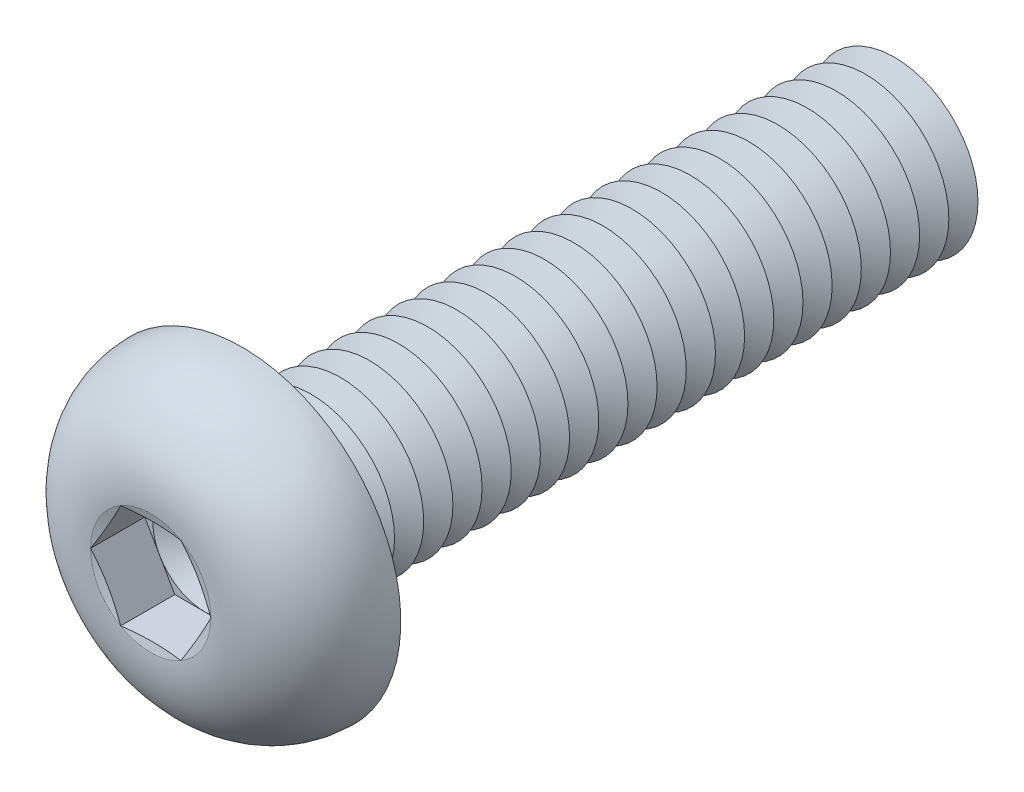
ISO-10303-21;
HEADER;
FILE_DESCRIPTION(('STEP AP214'),'2;1');
FILE_NAME('part.step','',(''),(''),'','','');
FILE_SCHEMA(('AUTOMOTIVE_DESIGN { 1 0 10303 214 1 1 1 1 }'));
ENDSEC;
DATA;
#1=APPLICATION_CONTEXT('core data for automotive mechanical design processes');
#2=APPLICATION_PROTOCOL_DEFINITION('international standard','automotive_design',2000,#1);
#3=PRODUCT_CONTEXT('',#1,'mechanical');
#4=PRODUCT('Part','Part','',(#3));
#5=PRODUCT_RELATED_PRODUCT_CATEGORY('part','',(#4));
#6=PRODUCT_DEFINITION_FORMATION('','',#4);
#7=PRODUCT_DEFINITION_CONTEXT('part definition',#1,'design');
#8=PRODUCT_DEFINITION('design','',#6,#7);
#9=PRODUCT_DEFINITION_SHAPE('','',#8);
#10=(LENGTH_UNIT() NAMED_UNIT(*) SI_UNIT(.MILLI.,.METRE.));
#11=(NAMED_UNIT(*) PLANE_ANGLE_UNIT() SI_UNIT($,.RADIAN.));
#12=(NAMED_UNIT(*) SI_UNIT($,.STERADIAN.) SOLID_ANGLE_UNIT());
#13=UNCERTAINTY_MEASURE_WITH_UNIT(LENGTH_MEASURE(1.E-05),#10,'distance_accuracy_value','');
#14=(GEOMETRIC_REPRESENTATION_CONTEXT(3) GLOBAL_UNCERTAINTY_ASSIGNED_CONTEXT((#13)) GLOBAL_UNIT_ASSIGNED_CONTEXT((#10,
#11,#12)) REPRESENTATION_CONTEXT('',''));
#15=CARTESIAN_POINT('',(0.,0.,0.));
#16=DIRECTION('',(0.,0.,1.));
#17=DIRECTION('',(1.,0.,0.));
#18=AXIS2_PLACEMENT_3D('',#15,#16,#17);
#19=CARTESIAN_POINT('',(0.,0.,0.9));
#20=DIRECTION('',(0.,0.,1.));
#21=DIRECTION('',(1.,0.,0.));
#22=AXIS2_PLACEMENT_3D('',#19,#20,#21);
#23=PLANE('',#22);
#24=CARTESIAN_POINT('',(0.,0.,0.9));
#25=DIRECTION('',(0.,0.,1.));
#26=DIRECTION('',(1.,0.,0.));
#27=AXIS2_PLACEMENT_3D('',#24,#25,#26);
#28=CIRCLE('',#27,1.24999941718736);
#29=CARTESIAN_POINT('',(1.08253125,0.624999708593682,0.9));
#30=VERTEX_POINT('',#29);
#31=CARTESIAN_POINT('',(0.,1.24999941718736,0.9));
#32=VERTEX_POINT('',#31);
#33=EDGE_CURVE('E118',#30,#32,#28,.T.);
#34=ORIENTED_EDGE('',*,*,#33,.F.);
#35=DIRECTION('',(-0.5,0.866025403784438,0.));
#36=VECTOR('',#35,1.);
#37=CARTESIAN_POINT('',(1.443375,0.,0.9));
#38=LINE('',#37,#36);
#39=CARTESIAN_POINT('',(0.7216875,1.24999941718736,0.9));
#40=VERTEX_POINT('',#39);
#41=EDGE_CURVE('E125',#30,#40,#38,.T.);
#42=ORIENTED_EDGE('',*,*,#41,.T.);
#43=DIRECTION('',(-1.,0.,0.));
#44=VECTOR('',#43,1.);
#45=CARTESIAN_POINT('',(0.7216875,1.24999941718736,0.9));
#46=LINE('',#45,#44);
#47=EDGE_CURVE('E136',#40,#32,#46,.T.);
#48=ORIENTED_EDGE('',*,*,#47,.T.);
#49=EDGE_LOOP('',(#34,#42,#48));
#50=FACE_BOUND('',#49,.T.);
#51=ADVANCED_FACE('F39',(#50),#23,.T.);
#52=CARTESIAN_POINT('',(0.,0.,0.9));
#53=DIRECTION('',(0.,0.,1.));
#54=DIRECTION('',(1.,0.,0.));
#55=AXIS2_PLACEMENT_3D('',#52,#53,#54);
#56=CIRCLE('',#55,1.24999941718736);
#57=CARTESIAN_POINT('',(-1.08253125,0.624999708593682,0.9));
#58=VERTEX_POINT('',#57);
#59=EDGE_CURVE('E11',#32,#58,#56,.T.);
#60=ORIENTED_EDGE('',*,*,#59,.F.);
#61=CARTESIAN_POINT('',(-0.721687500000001,1.24999941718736,0.9));
#62=VERTEX_POINT('',#61);
#63=EDGE_CURVE('E131',#32,#62,#46,.T.);
#64=ORIENTED_EDGE('',*,*,#63,.T.);
#65=DIRECTION('',(-0.5,-0.866025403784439,0.));
#66=VECTOR('',#65,1.);
#67=CARTESIAN_POINT('',(-0.721687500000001,1.24999941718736,0.9));
#68=LINE('',#67,#66);
#69=EDGE_CURVE('E134',#62,#58,#68,.T.);
#70=ORIENTED_EDGE('',*,*,#69,.T.);
#71=EDGE_LOOP('',(#60,#64,#70));
#72=FACE_BOUND('',#71,.T.);
#73=ADVANCED_FACE('F130',(#72),#23,.T.);
#74=CARTESIAN_POINT('',(-1.08253125,-0.624999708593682,0.9));
#75=VERTEX_POINT('',#74);
#76=EDGE_CURVE('E49',#58,#75,#56,.T.);
#77=ORIENTED_EDGE('',*,*,#76,.F.);
#78=CARTESIAN_POINT('',(-1.443375,0.,0.9));
#79=VERTEX_POINT('',#78);
#80=EDGE_CURVE('E143',#58,#79,#68,.T.);
#81=ORIENTED_EDGE('',*,*,#80,.T.);
#82=DIRECTION('',(0.5,-0.866025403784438,0.));
#83=VECTOR('',#82,1.);
#84=CARTESIAN_POINT('',(-1.443375,0.,0.9));
#85=LINE('',#84,#83);
#86=EDGE_CURVE('E152',#79,#75,#85,.T.);
#87=ORIENTED_EDGE('',*,*,#86,.T.);
#88=EDGE_LOOP('',(#77,#81,#87));
#89=FACE_BOUND('',#88,.T.);
#90=ADVANCED_FACE('F446',(#89),#23,.T.);
#91=CARTESIAN_POINT('',(0.,-1.24999941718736,0.9));
#92=VERTEX_POINT('',#91);
#93=EDGE_CURVE('E431',#75,#92,#56,.T.);
#94=ORIENTED_EDGE('',*,*,#93,.F.);
#95=CARTESIAN_POINT('',(-0.721687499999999,-1.24999941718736,0.9));
#96=VERTEX_POINT('',#95);
#97=EDGE_CURVE('E151',#75,#96,#85,.T.);
#98=ORIENTED_EDGE('',*,*,#97,.T.);
#99=DIRECTION('',(1.,0.,0.));
#100=VECTOR('',#99,1.);
#101=CARTESIAN_POINT('',(-0.721687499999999,-1.24999941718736,0.9));
#102=LINE('',#101,#100);
#103=EDGE_CURVE('E157',#96,#92,#102,.T.);
#104=ORIENTED_EDGE('',*,*,#103,.T.);
#105=EDGE_LOOP('',(#94,#98,#104));
#106=FACE_BOUND('',#105,.T.);
#107=ADVANCED_FACE('F439',(#106),#23,.T.);
#108=CARTESIAN_POINT('',(1.08253125,-0.624999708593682,0.9));
#109=VERTEX_POINT('',#108);
#110=EDGE_CURVE('E56',#92,#109,#56,.T.);
#111=ORIENTED_EDGE('',*,*,#110,.F.);
#112=CARTESIAN_POINT('',(0.721687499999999,-1.24999941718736,0.9));
#113=VERTEX_POINT('',#112);
#114=EDGE_CURVE('E156',#92,#113,#102,.T.);
#115=ORIENTED_EDGE('',*,*,#114,.T.);
#116=DIRECTION('',(0.5,0.866025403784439,0.));
#117=VECTOR('',#116,1.);
#118=CARTESIAN_POINT('',(0.721687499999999,-1.24999941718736,0.9));
#119=LINE('',#118,#117);
#120=EDGE_CURVE('E162',#113,#109,#119,.T.);
#121=ORIENTED_EDGE('',*,*,#120,.T.);
#122=EDGE_LOOP('',(#111,#115,#121));
#123=FACE_BOUND('',#122,.T.);
#124=ADVANCED_FACE('F525',(#123),#23,.T.);
#125=CARTESIAN_POINT('',(0.,0.,2.2));
#126=DIRECTION('',(0.,0.,1.));
#127=DIRECTION('',(1.,0.,0.));
#128=AXIS2_PLACEMENT_3D('',#125,#126,#127);
#129=CONICAL_SURFACE('',#128,1.443375,1.30899693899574);
#130=CARTESIAN_POINT('',(1.44349047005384,-0.000199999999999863,2.20003094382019));
#131=CARTESIAN_POINT('',(1.41351104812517,0.0517258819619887,2.19199301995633));
#132=CARTESIAN_POINT('',(1.38347725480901,0.10374593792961,2.18469579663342));
#133=CARTESIAN_POINT('',(1.32330355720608,0.207969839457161,2.17187512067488));
#134=CARTESIAN_POINT('',(1.29316361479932,0.260173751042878,2.16635238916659));
#135=CARTESIAN_POINT('',(1.23296043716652,0.364448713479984,2.15740323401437));
#136=CARTESIAN_POINT('',(1.20289760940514,0.416519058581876,2.15396613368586));
#137=CARTESIAN_POINT('',(1.14273359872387,0.520726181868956,2.14935732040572));
#138=CARTESIAN_POINT('',(1.11263242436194,0.572862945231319,2.14818516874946));
#139=CARTESIAN_POINT('',(1.05243007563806,0.677136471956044,2.14818516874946));
#140=CARTESIAN_POINT('',(1.02232890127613,0.729273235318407,2.14935732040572));
#141=CARTESIAN_POINT('',(0.962164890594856,0.833480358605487,2.15396613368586));
#142=CARTESIAN_POINT('',(0.932102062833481,0.885550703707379,2.15740323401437));
#143=CARTESIAN_POINT('',(0.87189888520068,0.989825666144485,2.16635238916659));
#144=CARTESIAN_POINT('',(0.841758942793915,1.0420295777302,2.17187512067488));
#145=CARTESIAN_POINT('',(0.781585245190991,1.14625347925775,2.18469579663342));
#146=CARTESIAN_POINT('',(0.751551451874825,1.19827353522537,2.19199301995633));
#147=CARTESIAN_POINT('',(0.721572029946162,1.25019941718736,2.20003094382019));
#148=B_SPLINE_CURVE_WITH_KNOTS('',3,(#130,#131,#132,#133,#134,#135,#136,#137,#138,#139,#140,
#141,#142,#143,#144,#145,#146,#147),.UNSPECIFIED.,.F.,.F.,(4,2,2,2,2,2,2,2,4),(0.,
0.181495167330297,0.363063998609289,0.543695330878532,0.724291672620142,0.904888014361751,
1.08551934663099,1.26708817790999,1.44858334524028),.UNSPECIFIED.);
#149=CARTESIAN_POINT('',(1.443375,0.,2.2));
#150=VERTEX_POINT('',#149);
#151=CARTESIAN_POINT('',(0.721687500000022,1.24999941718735,2.2));
#152=VERTEX_POINT('',#151);
#153=EDGE_CURVE('E222',#150,#152,#148,.T.);
#154=ORIENTED_EDGE('',*,*,#153,.F.);
#155=CARTESIAN_POINT('',(0.,0.,2.2));
#156=DIRECTION('',(0.,0.,-1.));
#157=DIRECTION('',(-1.,0.,0.));
#158=AXIS2_PLACEMENT_3D('',#155,#156,#157);
#159=CIRCLE('',#158,1.443375);
#160=EDGE_CURVE('E477',#152,#150,#159,.T.);
#161=ORIENTED_EDGE('',*,*,#160,.F.);
#162=EDGE_LOOP('',(#154,#161));
#163=FACE_BOUND('',#162,.T.);
#164=ADVANCED_FACE('F529',(#163),#129,.F.);
#165=CARTESIAN_POINT('',(0.721572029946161,-1.25019941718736,2.20003094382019));
#166=CARTESIAN_POINT('',(0.751551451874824,-1.19827353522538,2.19199301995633));
#167=CARTESIAN_POINT('',(0.78158524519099,-1.14625347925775,2.18469579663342));
#168=CARTESIAN_POINT('',(0.841758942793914,-1.0420295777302,2.17187512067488));
#169=CARTESIAN_POINT('',(0.87189888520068,-0.989825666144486,2.16635238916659));
#170=CARTESIAN_POINT('',(0.932102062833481,-0.88555070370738,2.15740323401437));
#171=CARTESIAN_POINT('',(0.962164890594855,-0.833480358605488,2.15396613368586));
#172=CARTESIAN_POINT('',(1.02232890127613,-0.729273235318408,2.14935732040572));
#173=CARTESIAN_POINT('',(1.05243007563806,-0.677136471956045,2.14818516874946));
#174=CARTESIAN_POINT('',(1.11263242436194,-0.572862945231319,2.14818516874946));
#175=CARTESIAN_POINT('',(1.14273359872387,-0.520726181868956,2.14935732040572));
#176=CARTESIAN_POINT('',(1.20289760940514,-0.416519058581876,2.15396613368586));
#177=CARTESIAN_POINT('',(1.23296043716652,-0.364448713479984,2.15740323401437));
#178=CARTESIAN_POINT('',(1.29316361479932,-0.260173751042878,2.16635238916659));
#179=CARTESIAN_POINT('',(1.32330355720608,-0.207969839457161,2.17187512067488));
#180=CARTESIAN_POINT('',(1.38347725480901,-0.10374593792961,2.18469579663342));
#181=CARTESIAN_POINT('',(1.41351104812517,-0.0517258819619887,2.19199301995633));
#182=CARTESIAN_POINT('',(1.44349047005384,0.000199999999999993,2.20003094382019));
#183=B_SPLINE_CURVE_WITH_KNOTS('',3,(#165,#166,#167,#168,#169,#170,#171,#172,#173,#174,#175,
#176,#177,#178,#179,#180,#181,#182),.UNSPECIFIED.,.F.,.F.,(4,2,2,2,2,2,2,2,4),(0.,
0.181495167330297,0.36306399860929,0.543695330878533,0.724291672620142,0.904888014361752,
1.085519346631,1.26708817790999,1.44858334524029),.UNSPECIFIED.);
#184=CARTESIAN_POINT('',(0.721687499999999,-1.24999941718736,2.2));
#185=VERTEX_POINT('',#184);
#186=EDGE_CURVE('E231',#185,#150,#183,.T.);
#187=ORIENTED_EDGE('',*,*,#186,.F.);
#188=EDGE_CURVE('E479',#150,#185,#159,.T.);
#189=ORIENTED_EDGE('',*,*,#188,.F.);
#190=EDGE_LOOP('',(#187,#189));
#191=FACE_BOUND('',#190,.T.);
#192=ADVANCED_FACE('F535',(#191),#129,.F.);
#193=CARTESIAN_POINT('',(-2.17815859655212,-1.24999941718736,2.48616275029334));
#194=CARTESIAN_POINT('',(-2.07269794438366,-1.24999941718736,2.4616881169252));
#195=CARTESIAN_POINT('',(-1.96714913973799,-1.24999941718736,2.43756889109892));
#196=CARTESIAN_POINT('',(-1.75576352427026,-1.24999941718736,2.39052699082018));
#197=CARTESIAN_POINT('',(-1.64992665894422,-1.24999941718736,2.36760456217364));
#198=CARTESIAN_POINT('',(-1.43690237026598,-1.24999941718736,2.3232454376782));
#199=CARTESIAN_POINT('',(-1.32971158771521,-1.24999941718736,2.30182468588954));
#200=CARTESIAN_POINT('',(-1.1148274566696,-1.24999941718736,2.26156703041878));
#201=CARTESIAN_POINT('',(-1.00713406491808,-1.24999941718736,2.24273035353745));
#202=CARTESIAN_POINT('',(-0.794044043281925,-1.24999941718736,2.2093913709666));
#203=CARTESIAN_POINT('',(-0.688664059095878,-1.24999941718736,2.19478562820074));
#204=CARTESIAN_POINT('',(-0.477310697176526,-1.24999941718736,2.17085809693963));
#205=CARTESIAN_POINT('',(-0.371337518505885,-1.24999941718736,2.16153463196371));
#206=CARTESIAN_POINT('',(-0.159455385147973,-1.24999941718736,2.14976770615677));
#207=CARTESIAN_POINT('',(-0.0535482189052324,-1.24999941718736,2.14729400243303));
#208=CARTESIAN_POINT('',(0.158189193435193,-1.24999941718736,2.14966287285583));
#209=CARTESIAN_POINT('',(0.264019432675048,-1.24999941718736,2.15450603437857));
#210=CARTESIAN_POINT('',(0.445148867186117,-1.24999941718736,2.16825380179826));
#211=CARTESIAN_POINT('',(0.520574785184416,-1.24999941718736,2.17561242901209));
#212=CARTESIAN_POINT('',(0.671115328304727,-1.24999941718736,2.19297000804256));
#213=CARTESIAN_POINT('',(0.746229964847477,-1.24999941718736,2.20296886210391));
#214=CARTESIAN_POINT('',(0.896387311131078,-1.24999941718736,2.22505910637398));
#215=CARTESIAN_POINT('',(0.971429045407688,-1.24999941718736,2.23715700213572));
#216=CARTESIAN_POINT('',(1.12124320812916,-1.24999941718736,2.26292371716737));
#217=CARTESIAN_POINT('',(1.19601562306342,-1.24999941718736,2.27659261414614));
#218=CARTESIAN_POINT('',(1.34686913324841,-1.24999941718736,2.30540811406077));
#219=CARTESIAN_POINT('',(1.42294548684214,-1.24999941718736,2.32057934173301));
#220=CARTESIAN_POINT('',(1.57490676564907,-1.24999941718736,2.351851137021));
#221=CARTESIAN_POINT('',(1.65079168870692,-1.24999941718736,2.36795171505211));
#222=CARTESIAN_POINT('',(1.80199501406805,-1.24999941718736,2.40076814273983));
#223=CARTESIAN_POINT('',(1.87731425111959,-1.24999941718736,2.41748016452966));
#224=CARTESIAN_POINT('',(2.02782424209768,-1.24999941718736,2.45144971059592));
#225=CARTESIAN_POINT('',(2.10301500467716,-1.24999941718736,2.46870719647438));
#226=CARTESIAN_POINT('',(2.17815859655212,-1.24999941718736,2.48616275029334));
#227=B_SPLINE_CURVE_WITH_KNOTS('',3,(#193,#194,#195,#196,#197,#198,#199,#200,#201,#202,#203,
#204,#205,#206,#207,#208,#209,#210,#211,#212,#213,#214,#215,#216,#217,#218,#219,#220,#221,#222,
#223,#224,#225,#226),.UNSPECIFIED.,.F.,.F.,(4,2,2,2,2,2,2,2,2,2,2,2,2,2,2,2,4),(0.,
0.324797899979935,0.649662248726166,0.977572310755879,1.30551113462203,1.62458166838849,
1.94355087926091,2.26110952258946,2.57869365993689,2.80599541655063,3.03328875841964,
3.2612995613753,3.48932164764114,3.7220371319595,3.95475522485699,4.18620606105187,
4.41764064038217),.UNSPECIFIED.);
#228=CARTESIAN_POINT('',(-0.721687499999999,-1.24999941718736,2.2));
#229=VERTEX_POINT('',#228);
#230=EDGE_CURVE('E458',#229,#185,#227,.T.);
#231=ORIENTED_EDGE('',*,*,#230,.F.);
#232=EDGE_CURVE('E466',#185,#229,#159,.T.);
#233=ORIENTED_EDGE('',*,*,#232,.F.);
#234=EDGE_LOOP('',(#231,#233));
#235=FACE_BOUND('',#234,.T.);
#236=ADVANCED_FACE('F540',(#235),#129,.F.);
#237=CARTESIAN_POINT('',(-1.44349047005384,0.000200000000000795,2.20003094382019));
#238=CARTESIAN_POINT('',(-1.41351104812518,-0.0517258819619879,2.19199301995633));
#239=CARTESIAN_POINT('',(-1.38347725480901,-0.10374593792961,2.18469579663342));
#240=CARTESIAN_POINT('',(-1.32330355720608,-0.20796983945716,2.17187512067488));
#241=CARTESIAN_POINT('',(-1.29316361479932,-0.260173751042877,2.16635238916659));
#242=CARTESIAN_POINT('',(-1.23296043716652,-0.364448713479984,2.15740323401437));
#243=CARTESIAN_POINT('',(-1.20289760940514,-0.416519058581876,2.15396613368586));
#244=CARTESIAN_POINT('',(-1.14273359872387,-0.520726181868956,2.14935732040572));
#245=CARTESIAN_POINT('',(-1.11263242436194,-0.572862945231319,2.14818516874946));
#246=CARTESIAN_POINT('',(-1.05243007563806,-0.677136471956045,2.14818516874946));
#247=CARTESIAN_POINT('',(-1.02232890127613,-0.729273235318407,2.14935732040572));
#248=CARTESIAN_POINT('',(-0.962164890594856,-0.833480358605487,2.15396613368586));
#249=CARTESIAN_POINT('',(-0.932102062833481,-0.885550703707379,2.15740323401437));
#250=CARTESIAN_POINT('',(-0.87189888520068,-0.989825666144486,2.16635238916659));
#251=CARTESIAN_POINT('',(-0.841758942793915,-1.0420295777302,2.17187512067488));
#252=CARTESIAN_POINT('',(-0.78158524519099,-1.14625347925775,2.18469579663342));
#253=CARTESIAN_POINT('',(-0.751551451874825,-1.19827353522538,2.19199301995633));
#254=CARTESIAN_POINT('',(-0.721572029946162,-1.25019941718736,2.20003094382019));
#255=B_SPLINE_CURVE_WITH_KNOTS('',3,(#237,#238,#239,#240,#241,#242,#243,#244,#245,#246,#247,
#248,#249,#250,#251,#252,#253,#254),.UNSPECIFIED.,.F.,.F.,(4,2,2,2,2,2,2,2,4),(0.,
0.181495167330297,0.36306399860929,0.543695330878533,0.724291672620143,0.904888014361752,
1.085519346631,1.26708817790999,1.44858334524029),.UNSPECIFIED.);
#256=CARTESIAN_POINT('',(-1.443375,0.,2.2));
#257=VERTEX_POINT('',#256);
#258=EDGE_CURVE('E451',#257,#229,#255,.T.);
#259=ORIENTED_EDGE('',*,*,#258,.F.);
#260=EDGE_CURVE('E411',#229,#257,#159,.T.);
#261=ORIENTED_EDGE('',*,*,#260,.F.);
#262=EDGE_LOOP('',(#259,#261));
#263=FACE_BOUND('',#262,.T.);
#264=ADVANCED_FACE('F455',(#263),#129,.F.);
#265=CARTESIAN_POINT('',(-0.721572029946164,1.25019941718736,2.20003094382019));
#266=CARTESIAN_POINT('',(-0.751551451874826,1.19827353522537,2.19199301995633));
#267=CARTESIAN_POINT('',(-0.781585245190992,1.14625347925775,2.18469579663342));
#268=CARTESIAN_POINT('',(-0.841758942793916,1.0420295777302,2.17187512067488));
#269=CARTESIAN_POINT('',(-0.871898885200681,0.989825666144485,2.16635238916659));
#270=CARTESIAN_POINT('',(-0.932102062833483,0.885550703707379,2.15740323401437));
#271=CARTESIAN_POINT('',(-0.962164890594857,0.833480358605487,2.15396613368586));
#272=CARTESIAN_POINT('',(-1.02232890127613,0.729273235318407,2.14935732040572));
#273=CARTESIAN_POINT('',(-1.05243007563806,0.677136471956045,2.14818516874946));
#274=CARTESIAN_POINT('',(-1.11263242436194,0.572862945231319,2.14818516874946));
#275=CARTESIAN_POINT('',(-1.14273359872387,0.520726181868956,2.14935732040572));
#276=CARTESIAN_POINT('',(-1.20289760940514,0.416519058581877,2.15396613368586));
#277=CARTESIAN_POINT('',(-1.23296043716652,0.364448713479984,2.15740323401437));
#278=CARTESIAN_POINT('',(-1.29316361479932,0.260173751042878,2.16635238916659));
#279=CARTESIAN_POINT('',(-1.32330355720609,0.207969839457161,2.17187512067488));
#280=CARTESIAN_POINT('',(-1.38347725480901,0.103745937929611,2.18469579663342));
#281=CARTESIAN_POINT('',(-1.41351104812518,0.0517258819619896,2.19199301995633));
#282=CARTESIAN_POINT('',(-1.44349047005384,-0.00019999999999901,2.20003094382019));
#283=B_SPLINE_CURVE_WITH_KNOTS('',3,(#265,#266,#267,#268,#269,#270,#271,#272,#273,#274,#275,
#276,#277,#278,#279,#280,#281,#282),.UNSPECIFIED.,.F.,.F.,(4,2,2,2,2,2,2,2,4),(0.,
0.181495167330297,0.363063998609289,0.543695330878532,0.724291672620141,0.90488801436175,
1.08551934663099,1.26708817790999,1.44858334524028),.UNSPECIFIED.);
#284=CARTESIAN_POINT('',(-0.721687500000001,1.24999941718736,2.2));
#285=VERTEX_POINT('',#284);
#286=EDGE_CURVE('E195',#285,#257,#283,.T.);
#287=ORIENTED_EDGE('',*,*,#286,.F.);
#288=EDGE_CURVE('E412',#257,#285,#159,.T.);
#289=ORIENTED_EDGE('',*,*,#288,.F.);
#290=EDGE_LOOP('',(#287,#289));
#291=FACE_BOUND('',#290,.T.);
#292=ADVANCED_FACE('F469',(#291),#129,.F.);
#293=CARTESIAN_POINT('',(0.,0.,-13.55));
#294=DIRECTION('',(0.,0.,1.));
#295=DIRECTION('',(1.,0.,0.));
#296=AXIS2_PLACEMENT_3D('',#293,#294,#295);
#297=CONICAL_SURFACE('',#296,2.00000000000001,1.0471975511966);
#298=CARTESIAN_POINT('',(0.,0.,-13.9));
#299=DIRECTION('',(0.,0.,1.));
#300=DIRECTION('',(1.,0.,0.));
#301=AXIS2_PLACEMENT_3D('',#298,#299,#300);
#302=CIRCLE('',#301,1.3937822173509);
#303=CARTESIAN_POINT('',(1.3937822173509,0.,-13.9));
#304=VERTEX_POINT('',#303);
#305=EDGE_CURVE('E384',#304,#304,#302,.T.);
#306=ORIENTED_EDGE('',*,*,#305,.T.);
#307=EDGE_LOOP('',(#306));
#308=FACE_BOUND('',#307,.T.);
#309=CARTESIAN_POINT('',(0.,0.,-13.55));
#310=DIRECTION('',(0.,0.,1.));
#311=DIRECTION('',(1.,0.,0.));
#312=AXIS2_PLACEMENT_3D('',#309,#310,#311);
#313=CIRCLE('',#312,2.00000000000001);
#314=CARTESIAN_POINT('',(2.00000000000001,0.,-13.55));
#315=VERTEX_POINT('',#314);
#316=EDGE_CURVE('E380',#315,#315,#313,.T.);
#317=ORIENTED_EDGE('',*,*,#316,.F.);
#318=EDGE_LOOP('',(#317));
#319=FACE_BOUND('',#318,.T.);
#320=ADVANCED_FACE('F606',(#308,#319),#297,.T.);
#321=CARTESIAN_POINT('',(0.,0.,-13.9));
#322=DIRECTION('',(0.,0.,-1.));
#323=DIRECTION('',(-1.,0.,0.));
#324=AXIS2_PLACEMENT_3D('',#321,#322,#323);
#325=CONICAL_SURFACE('',#324,1.3937822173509,1.0471975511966);
#326=CARTESIAN_POINT('',(0.,0.,-14.25));
#327=DIRECTION('',(0.,0.,1.));
#328=DIRECTION('',(1.,0.,0.));
#329=AXIS2_PLACEMENT_3D('',#326,#327,#328);
#330=CIRCLE('',#329,2.00000000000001);
#331=CARTESIAN_POINT('',(2.00000000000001,0.,-14.25));
#332=VERTEX_POINT('',#331);
#333=EDGE_CURVE('E388',#332,#332,#330,.T.);
#334=ORIENTED_EDGE('',*,*,#333,.T.);
#335=EDGE_LOOP('',(#334));
#336=FACE_BOUND('',#335,.T.);
#337=ORIENTED_EDGE('',*,*,#305,.F.);
#338=EDGE_LOOP('',(#337));
#339=FACE_BOUND('',#338,.T.);
#340=ADVANCED_FACE('F993',(#336,#339),#325,.T.);
#341=CARTESIAN_POINT('',(0.,2.00000000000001,-16.));
#342=DIRECTION('',(0.,0.,-1.));
#343=DIRECTION('',(-1.,0.,0.));
#344=AXIS2_PLACEMENT_3D('',#341,#342,#343);
#345=PLANE('',#344);
#346=CARTESIAN_POINT('',(0.,0.,-16.));
#347=DIRECTION('',(0.,0.,1.));
#348=DIRECTION('',(1.,0.,0.));
#349=AXIS2_PLACEMENT_3D('',#346,#347,#348);
#350=CIRCLE('',#349,1.3937822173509);
#351=CARTESIAN_POINT('',(1.3937822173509,0.,-16.));
#352=VERTEX_POINT('',#351);
#353=EDGE_CURVE('E407',#352,#352,#350,.T.);
#354=ORIENTED_EDGE('',*,*,#353,.F.);
#355=EDGE_LOOP('',(#354));
#356=FACE_BOUND('',#355,.T.);
#357=ADVANCED_FACE('F987',(#356),#345,.T.);
#358=CARTESIAN_POINT('',(0.,0.,-15.65));
#359=DIRECTION('',(0.,0.,1.));
#360=DIRECTION('',(1.,0.,0.));
#361=AXIS2_PLACEMENT_3D('',#358,#359,#360);
#362=CONICAL_SURFACE('',#361,2.00000000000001,1.0471975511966);
#363=ORIENTED_EDGE('',*,*,#353,.T.);
#364=EDGE_LOOP('',(#363));
#365=FACE_BOUND('',#364,.T.);
#366=CARTESIAN_POINT('',(0.,0.,-15.65));
#367=DIRECTION('',(0.,0.,1.));
#368=DIRECTION('',(1.,0.,0.));
#369=AXIS2_PLACEMENT_3D('',#366,#367,#368);
#370=CIRCLE('',#369,2.00000000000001);
#371=CARTESIAN_POINT('',(2.00000000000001,0.,-15.65));
#372=VERTEX_POINT('',#371);
#373=EDGE_CURVE('E403',#372,#372,#370,.T.);
#374=ORIENTED_EDGE('',*,*,#373,.F.);
#375=EDGE_LOOP('',(#374));
#376=FACE_BOUND('',#375,.T.);
#377=ADVANCED_FACE('F980',(#365,#376),#362,.T.);
#378=CARTESIAN_POINT('',(0.,0.,-15.3));
#379=DIRECTION('',(0.,0.,-1.));
#380=DIRECTION('',(-1.,0.,0.));
#381=AXIS2_PLACEMENT_3D('',#378,#379,#380);
#382=CONICAL_SURFACE('',#381,1.3937822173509,1.0471975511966);
#383=ORIENTED_EDGE('',*,*,#373,.T.);
#384=EDGE_LOOP('',(#383));
#385=FACE_BOUND('',#384,.T.);
#386=CARTESIAN_POINT('',(0.,0.,-15.3));
#387=DIRECTION('',(0.,0.,1.));
#388=DIRECTION('',(1.,0.,0.));
#389=AXIS2_PLACEMENT_3D('',#386,#387,#388);
#390=CIRCLE('',#389,1.3937822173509);
#391=CARTESIAN_POINT('',(1.3937822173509,0.,-15.3));
#392=VERTEX_POINT('',#391);
#393=EDGE_CURVE('E400',#392,#392,#390,.T.);
#394=ORIENTED_EDGE('',*,*,#393,.F.);
#395=EDGE_LOOP('',(#394));
#396=FACE_BOUND('',#395,.T.);
#397=ADVANCED_FACE('F973',(#385,#396),#382,.T.);
#398=CARTESIAN_POINT('',(0.,0.,-14.95));
#399=DIRECTION('',(0.,0.,1.));
#400=DIRECTION('',(1.,0.,0.));
#401=AXIS2_PLACEMENT_3D('',#398,#399,#400);
#402=CONICAL_SURFACE('',#401,2.00000000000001,1.0471975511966);
#403=ORIENTED_EDGE('',*,*,#393,.T.);
#404=EDGE_LOOP('',(#403));
#405=FACE_BOUND('',#404,.T.);
#406=CARTESIAN_POINT('',(0.,0.,-14.95));
#407=DIRECTION('',(0.,0.,1.));
#408=DIRECTION('',(1.,0.,0.));
#409=AXIS2_PLACEMENT_3D('',#406,#407,#408);
#410=CIRCLE('',#409,2.00000000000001);
#411=CARTESIAN_POINT('',(2.00000000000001,0.,-14.95));
#412=VERTEX_POINT('',#411);
#413=EDGE_CURVE('E396',#412,#412,#410,.T.);
#414=ORIENTED_EDGE('',*,*,#413,.F.);
#415=EDGE_LOOP('',(#414));
#416=FACE_BOUND('',#415,.T.);
#417=ADVANCED_FACE('F966',(#405,#416),#402,.T.);
#418=CARTESIAN_POINT('',(0.,0.,-14.6));
#419=DIRECTION('',(0.,0.,-1.));
#420=DIRECTION('',(-1.,0.,0.));
#421=AXIS2_PLACEMENT_3D('',#418,#419,#420);
#422=CONICAL_SURFACE('',#421,1.3937822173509,1.0471975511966);
#423=ORIENTED_EDGE('',*,*,#413,.T.);
#424=EDGE_LOOP('',(#423));
#425=FACE_BOUND('',#424,.T.);
#426=CARTESIAN_POINT('',(0.,0.,-14.6));
#427=DIRECTION('',(0.,0.,1.));
#428=DIRECTION('',(1.,0.,0.));
#429=AXIS2_PLACEMENT_3D('',#426,#427,#428);
#430=CIRCLE('',#429,1.3937822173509);
#431=CARTESIAN_POINT('',(1.3937822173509,0.,-14.6));
#432=VERTEX_POINT('',#431);
#433=EDGE_CURVE('E392',#432,#432,#430,.T.);
#434=ORIENTED_EDGE('',*,*,#433,.F.);
#435=EDGE_LOOP('',(#434));
#436=FACE_BOUND('',#435,.T.);
#437=ADVANCED_FACE('F959',(#425,#436),#422,.T.);
#438=CARTESIAN_POINT('',(0.,0.,-14.25));
#439=DIRECTION('',(0.,0.,1.));
#440=DIRECTION('',(1.,0.,0.));
#441=AXIS2_PLACEMENT_3D('',#438,#439,#440);
#442=CONICAL_SURFACE('',#441,2.00000000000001,1.0471975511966);
#443=ORIENTED_EDGE('',*,*,#433,.T.);
#444=EDGE_LOOP('',(#443));
#445=FACE_BOUND('',#444,.T.);
#446=ORIENTED_EDGE('',*,*,#333,.F.);
#447=EDGE_LOOP('',(#446));
#448=FACE_BOUND('',#447,.T.);
#449=ADVANCED_FACE('F952',(#445,#448),#442,.T.);
#450=CARTESIAN_POINT('',(0.,0.,-12.85));
#451=DIRECTION('',(0.,0.,1.));
#452=DIRECTION('',(1.,0.,0.));
#453=AXIS2_PLACEMENT_3D('',#450,#451,#452);
#454=CONICAL_SURFACE('',#453,2.00000000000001,1.0471975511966);
#455=CARTESIAN_POINT('',(0.,0.,-13.2));
#456=DIRECTION('',(0.,0.,1.));
#457=DIRECTION('',(1.,0.,0.));
#458=AXIS2_PLACEMENT_3D('',#455,#456,#457);
#459=CIRCLE('',#458,1.3937822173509);
#460=CARTESIAN_POINT('',(1.3937822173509,0.,-13.2));
#461=VERTEX_POINT('',#460);
#462=EDGE_CURVE('E376',#461,#461,#459,.T.);
#463=ORIENTED_EDGE('',*,*,#462,.T.);
#464=EDGE_LOOP('',(#463));
#465=FACE_BOUND('',#464,.T.);
#466=CARTESIAN_POINT('',(0.,0.,-12.85));
#467=DIRECTION('',(0.,0.,1.));
#468=DIRECTION('',(1.,0.,0.));
#469=AXIS2_PLACEMENT_3D('',#466,#467,#468);
#470=CIRCLE('',#469,2.00000000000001);
#471=CARTESIAN_POINT('',(2.00000000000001,0.,-12.85));
#472=VERTEX_POINT('',#471);
#473=EDGE_CURVE('E372',#472,#472,#470,.T.);
#474=ORIENTED_EDGE('',*,*,#473,.F.);
#475=EDGE_LOOP('',(#474));
#476=FACE_BOUND('',#475,.T.);
#477=ADVANCED_FACE('F945',(#465,#476),#454,.T.);
#478=CARTESIAN_POINT('',(0.,0.,-13.2));
#479=DIRECTION('',(0.,0.,-1.));
#480=DIRECTION('',(-1.,0.,0.));
#481=AXIS2_PLACEMENT_3D('',#478,#479,#480);
#482=CONICAL_SURFACE('',#481,1.3937822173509,1.0471975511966);
#483=ORIENTED_EDGE('',*,*,#316,.T.);
#484=EDGE_LOOP('',(#483));
#485=FACE_BOUND('',#484,.T.);
#486=ORIENTED_EDGE('',*,*,#462,.F.);
#487=EDGE_LOOP('',(#486));
#488=FACE_BOUND('',#487,.T.);
#489=ADVANCED_FACE('F938',(#485,#488),#482,.T.);
#490=CARTESIAN_POINT('',(0.,0.,-12.15));
#491=DIRECTION('',(0.,0.,1.));
#492=DIRECTION('',(1.,0.,0.));
#493=AXIS2_PLACEMENT_3D('',#490,#491,#492);
#494=CONICAL_SURFACE('',#493,2.00000000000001,1.0471975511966);
#495=CARTESIAN_POINT('',(0.,0.,-12.5));
#496=DIRECTION('',(0.,0.,1.));
#497=DIRECTION('',(1.,0.,0.));
#498=AXIS2_PLACEMENT_3D('',#495,#496,#497);
#499=CIRCLE('',#498,1.3937822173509);
#500=CARTESIAN_POINT('',(1.3937822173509,0.,-12.5));
#501=VERTEX_POINT('',#500);
#502=EDGE_CURVE('E368',#501,#501,#499,.T.);
#503=ORIENTED_EDGE('',*,*,#502,.T.);
#504=EDGE_LOOP('',(#503));
#505=FACE_BOUND('',#504,.T.);
#506=CARTESIAN_POINT('',(0.,0.,-12.15));
#507=DIRECTION('',(0.,0.,1.));
#508=DIRECTION('',(1.,0.,0.));
#509=AXIS2_PLACEMENT_3D('',#506,#507,#508);
#510=CIRCLE('',#509,2.00000000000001);
#511=CARTESIAN_POINT('',(2.00000000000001,0.,-12.15));
#512=VERTEX_POINT('',#511);
#513=EDGE_CURVE('E364',#512,#512,#510,.T.);
#514=ORIENTED_EDGE('',*,*,#513,.F.);
#515=EDGE_LOOP('',(#514));
#516=FACE_BOUND('',#515,.T.);
#517=ADVANCED_FACE('F931',(#505,#516),#494,.T.);
#518=CARTESIAN_POINT('',(0.,0.,-12.5));
#519=DIRECTION('',(0.,0.,-1.));
#520=DIRECTION('',(-1.,0.,0.));
#521=AXIS2_PLACEMENT_3D('',#518,#519,#520);
#522=CONICAL_SURFACE('',#521,1.3937822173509,1.0471975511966);
#523=ORIENTED_EDGE('',*,*,#473,.T.);
#524=EDGE_LOOP('',(#523));
#525=FACE_BOUND('',#524,.T.);
#526=ORIENTED_EDGE('',*,*,#502,.F.);
#527=EDGE_LOOP('',(#526));
#528=FACE_BOUND('',#527,.T.);
#529=ADVANCED_FACE('F924',(#525,#528),#522,.T.);
#530=CARTESIAN_POINT('',(0.,0.,-11.45));
#531=DIRECTION('',(0.,0.,1.));
#532=DIRECTION('',(1.,0.,0.));
#533=AXIS2_PLACEMENT_3D('',#530,#531,#532);
#534=CONICAL_SURFACE('',#533,2.00000000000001,1.0471975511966);
#535=CARTESIAN_POINT('',(0.,0.,-11.8));
#536=DIRECTION('',(0.,0.,1.));
#537=DIRECTION('',(1.,0.,0.));
#538=AXIS2_PLACEMENT_3D('',#535,#536,#537);
#539=CIRCLE('',#538,1.3937822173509);
#540=CARTESIAN_POINT('',(1.3937822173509,0.,-11.8));
#541=VERTEX_POINT('',#540);
#542=EDGE_CURVE('E360',#541,#541,#539,.T.);
#543=ORIENTED_EDGE('',*,*,#542,.T.);
#544=EDGE_LOOP('',(#543));
#545=FACE_BOUND('',#544,.T.);
#546=CARTESIAN_POINT('',(0.,0.,-11.45));
#547=DIRECTION('',(0.,0.,1.));
#548=DIRECTION('',(1.,0.,0.));
#549=AXIS2_PLACEMENT_3D('',#546,#547,#548);
#550=CIRCLE('',#549,2.00000000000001);
#551=CARTESIAN_POINT('',(2.00000000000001,0.,-11.45));
#552=VERTEX_POINT('',#551);
#553=EDGE_CURVE('E356',#552,#552,#550,.T.);
#554=ORIENTED_EDGE('',*,*,#553,.F.);
#555=EDGE_LOOP('',(#554));
#556=FACE_BOUND('',#555,.T.);
#557=ADVANCED_FACE('F917',(#545,#556),#534,.T.);
#558=CARTESIAN_POINT('',(0.,0.,-11.8));
#559=DIRECTION('',(0.,0.,-1.));
#560=DIRECTION('',(-1.,0.,0.));
#561=AXIS2_PLACEMENT_3D('',#558,#559,#560);
#562=CONICAL_SURFACE('',#561,1.3937822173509,1.0471975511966);
#563=ORIENTED_EDGE('',*,*,#513,.T.);
#564=EDGE_LOOP('',(#563));
#565=FACE_BOUND('',#564,.T.);
#566=ORIENTED_EDGE('',*,*,#542,.F.);
#567=EDGE_LOOP('',(#566));
#568=FACE_BOUND('',#567,.T.);
#569=ADVANCED_FACE('F910',(#565,#568),#562,.T.);
#570=CARTESIAN_POINT('',(0.,0.,-10.75));
#571=DIRECTION('',(0.,0.,1.));
#572=DIRECTION('',(1.,0.,0.));
#573=AXIS2_PLACEMENT_3D('',#570,#571,#572);
#574=CONICAL_SURFACE('',#573,2.00000000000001,1.0471975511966);
#575=CARTESIAN_POINT('',(0.,0.,-11.1));
#576=DIRECTION('',(0.,0.,1.));
#577=DIRECTION('',(1.,0.,0.));
#578=AXIS2_PLACEMENT_3D('',#575,#576,#577);
#579=CIRCLE('',#578,1.3937822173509);
#580=CARTESIAN_POINT('',(1.3937822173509,0.,-11.1));
#581=VERTEX_POINT('',#580);
#582=EDGE_CURVE('E352',#581,#581,#579,.T.);
#583=ORIENTED_EDGE('',*,*,#582,.T.);
#584=EDGE_LOOP('',(#583));
#585=FACE_BOUND('',#584,.T.);
#586=CARTESIAN_POINT('',(0.,0.,-10.75));
#587=DIRECTION('',(0.,0.,1.));
#588=DIRECTION('',(1.,0.,0.));
#589=AXIS2_PLACEMENT_3D('',#586,#587,#588);
#590=CIRCLE('',#589,2.00000000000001);
#591=CARTESIAN_POINT('',(2.00000000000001,0.,-10.75));
#592=VERTEX_POINT('',#591);
#593=EDGE_CURVE('E348',#592,#592,#590,.T.);
#594=ORIENTED_EDGE('',*,*,#593,.F.);
#595=EDGE_LOOP('',(#594));
#596=FACE_BOUND('',#595,.T.);
#597=ADVANCED_FACE('F903',(#585,#596),#574,.T.);
#598=CARTESIAN_POINT('',(0.,0.,-11.1));
#599=DIRECTION('',(0.,0.,-1.));
#600=DIRECTION('',(-1.,0.,0.));
#601=AXIS2_PLACEMENT_3D('',#598,#599,#600);
#602=CONICAL_SURFACE('',#601,1.3937822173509,1.0471975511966);
#603=ORIENTED_EDGE('',*,*,#553,.T.);
#604=EDGE_LOOP('',(#603));
#605=FACE_BOUND('',#604,.T.);
#606=ORIENTED_EDGE('',*,*,#582,.F.);
#607=EDGE_LOOP('',(#606));
#608=FACE_BOUND('',#607,.T.);
#609=ADVANCED_FACE('F896',(#605,#608),#602,.T.);
#610=CARTESIAN_POINT('',(0.,0.,-10.05));
#611=DIRECTION('',(0.,0.,1.));
#612=DIRECTION('',(1.,0.,0.));
#613=AXIS2_PLACEMENT_3D('',#610,#611,#612);
#614=CONICAL_SURFACE('',#613,2.00000000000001,1.0471975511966);
#615=CARTESIAN_POINT('',(0.,0.,-10.4));
#616=DIRECTION('',(0.,0.,1.));
#617=DIRECTION('',(1.,0.,0.));
#618=AXIS2_PLACEMENT_3D('',#615,#616,#617);
#619=CIRCLE('',#618,1.3937822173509);
#620=CARTESIAN_POINT('',(1.3937822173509,0.,-10.4));
#621=VERTEX_POINT('',#620);
#622=EDGE_CURVE('E344',#621,#621,#619,.T.);
#623=ORIENTED_EDGE('',*,*,#622,.T.);
#624=EDGE_LOOP('',(#623));
#625=FACE_BOUND('',#624,.T.);
#626=CARTESIAN_POINT('',(0.,0.,-10.05));
#627=DIRECTION('',(0.,0.,1.));
#628=DIRECTION('',(1.,0.,0.));
#629=AXIS2_PLACEMENT_3D('',#626,#627,#628);
#630=CIRCLE('',#629,2.00000000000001);
#631=CARTESIAN_POINT('',(2.00000000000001,0.,-10.05));
#632=VERTEX_POINT('',#631);
#633=EDGE_CURVE('E340',#632,#632,#630,.T.);
#634=ORIENTED_EDGE('',*,*,#633,.F.);
#635=EDGE_LOOP('',(#634));
#636=FACE_BOUND('',#635,.T.);
#637=ADVANCED_FACE('F889',(#625,#636),#614,.T.);
#638=CARTESIAN_POINT('',(0.,0.,-10.4));
#639=DIRECTION('',(0.,0.,-1.));
#640=DIRECTION('',(-1.,0.,0.));
#641=AXIS2_PLACEMENT_3D('',#638,#639,#640);
#642=CONICAL_SURFACE('',#641,1.3937822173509,1.0471975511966);
#643=ORIENTED_EDGE('',*,*,#593,.T.);
#644=EDGE_LOOP('',(#643));
#645=FACE_BOUND('',#644,.T.);
#646=ORIENTED_EDGE('',*,*,#622,.F.);
#647=EDGE_LOOP('',(#646));
#648=FACE_BOUND('',#647,.T.);
#649=ADVANCED_FACE('F882',(#645,#648),#642,.T.);
#650=CARTESIAN_POINT('',(0.,0.,-9.35));
#651=DIRECTION('',(0.,0.,1.));
#652=DIRECTION('',(1.,0.,0.));
#653=AXIS2_PLACEMENT_3D('',#650,#651,#652);
#654=CONICAL_SURFACE('',#653,2.00000000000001,1.0471975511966);
#655=CARTESIAN_POINT('',(0.,0.,-9.7));
#656=DIRECTION('',(0.,0.,1.));
#657=DIRECTION('',(1.,0.,0.));
#658=AXIS2_PLACEMENT_3D('',#655,#656,#657);
#659=CIRCLE('',#658,1.3937822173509);
#660=CARTESIAN_POINT('',(1.3937822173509,0.,-9.7));
#661=VERTEX_POINT('',#660);
#662=EDGE_CURVE('E336',#661,#661,#659,.T.);
#663=ORIENTED_EDGE('',*,*,#662,.T.);
#664=EDGE_LOOP('',(#663));
#665=FACE_BOUND('',#664,.T.);
#666=CARTESIAN_POINT('',(0.,0.,-9.35));
#667=DIRECTION('',(0.,0.,1.));
#668=DIRECTION('',(1.,0.,0.));
#669=AXIS2_PLACEMENT_3D('',#666,#667,#668);
#670=CIRCLE('',#669,2.00000000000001);
#671=CARTESIAN_POINT('',(2.00000000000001,0.,-9.35));
#672=VERTEX_POINT('',#671);
#673=EDGE_CURVE('E332',#672,#672,#670,.T.);
#674=ORIENTED_EDGE('',*,*,#673,.F.);
#675=EDGE_LOOP('',(#674));
#676=FACE_BOUND('',#675,.T.);
#677=ADVANCED_FACE('F875',(#665,#676),#654,.T.);
#678=CARTESIAN_POINT('',(0.,0.,-9.7));
#679=DIRECTION('',(0.,0.,-1.));
#680=DIRECTION('',(-1.,0.,0.));
#681=AXIS2_PLACEMENT_3D('',#678,#679,#680);
#682=CONICAL_SURFACE('',#681,1.3937822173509,1.0471975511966);
#683=ORIENTED_EDGE('',*,*,#633,.T.);
#684=EDGE_LOOP('',(#683));
#685=FACE_BOUND('',#684,.T.);
#686=ORIENTED_EDGE('',*,*,#662,.F.);
#687=EDGE_LOOP('',(#686));
#688=FACE_BOUND('',#687,.T.);
#689=ADVANCED_FACE('F868',(#685,#688),#682,.T.);
#690=CARTESIAN_POINT('',(0.,0.,-8.65));
#691=DIRECTION('',(0.,0.,1.));
#692=DIRECTION('',(1.,0.,0.));
#693=AXIS2_PLACEMENT_3D('',#690,#691,#692);
#694=CONICAL_SURFACE('',#693,2.00000000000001,1.0471975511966);
#695=CARTESIAN_POINT('',(0.,0.,-9.));
#696=DIRECTION('',(0.,0.,1.));
#697=DIRECTION('',(1.,0.,0.));
#698=AXIS2_PLACEMENT_3D('',#695,#696,#697);
#699=CIRCLE('',#698,1.3937822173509);
#700=CARTESIAN_POINT('',(1.3937822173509,0.,-9.));
#701=VERTEX_POINT('',#700);
#702=EDGE_CURVE('E328',#701,#701,#699,.T.);
#703=ORIENTED_EDGE('',*,*,#702,.T.);
#704=EDGE_LOOP('',(#703));
#705=FACE_BOUND('',#704,.T.);
#706=CARTESIAN_POINT('',(0.,0.,-8.65));
#707=DIRECTION('',(0.,0.,1.));
#708=DIRECTION('',(1.,0.,0.));
#709=AXIS2_PLACEMENT_3D('',#706,#707,#708);
#710=CIRCLE('',#709,2.00000000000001);
#711=CARTESIAN_POINT('',(2.00000000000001,0.,-8.65));
#712=VERTEX_POINT('',#711);
#713=EDGE_CURVE('E324',#712,#712,#710,.T.);
#714=ORIENTED_EDGE('',*,*,#713,.F.);
#715=EDGE_LOOP('',(#714));
#716=FACE_BOUND('',#715,.T.);
#717=ADVANCED_FACE('F861',(#705,#716),#694,.T.);
#718=CARTESIAN_POINT('',(0.,0.,-9.));
#719=DIRECTION('',(0.,0.,-1.));
#720=DIRECTION('',(-1.,0.,0.));
#721=AXIS2_PLACEMENT_3D('',#718,#719,#720);
#722=CONICAL_SURFACE('',#721,1.3937822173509,1.0471975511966);
#723=ORIENTED_EDGE('',*,*,#673,.T.);
#724=EDGE_LOOP('',(#723));
#725=FACE_BOUND('',#724,.T.);
#726=ORIENTED_EDGE('',*,*,#702,.F.);
#727=EDGE_LOOP('',(#726));
#728=FACE_BOUND('',#727,.T.);
#729=ADVANCED_FACE('F854',(#725,#728),#722,.T.);
#730=CARTESIAN_POINT('',(0.,0.,-7.95));
#731=DIRECTION('',(0.,0.,1.));
#732=DIRECTION('',(1.,0.,0.));
#733=AXIS2_PLACEMENT_3D('',#730,#731,#732);
#734=CONICAL_SURFACE('',#733,2.00000000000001,1.0471975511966);
#735=CARTESIAN_POINT('',(0.,0.,-8.3));
#736=DIRECTION('',(0.,0.,1.));
#737=DIRECTION('',(1.,0.,0.));
#738=AXIS2_PLACEMENT_3D('',#735,#736,#737);
#739=CIRCLE('',#738,1.3937822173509);
#740=CARTESIAN_POINT('',(1.3937822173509,0.,-8.3));
#741=VERTEX_POINT('',#740);
#742=EDGE_CURVE('E320',#741,#741,#739,.T.);
#743=ORIENTED_EDGE('',*,*,#742,.T.);
#744=EDGE_LOOP('',(#743));
#745=FACE_BOUND('',#744,.T.);
#746=CARTESIAN_POINT('',(0.,0.,-7.95));
#747=DIRECTION('',(0.,0.,1.));
#748=DIRECTION('',(1.,0.,0.));
#749=AXIS2_PLACEMENT_3D('',#746,#747,#748);
#750=CIRCLE('',#749,2.00000000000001);
#751=CARTESIAN_POINT('',(2.00000000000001,0.,-7.95));
#752=VERTEX_POINT('',#751);
#753=EDGE_CURVE('E316',#752,#752,#750,.T.);
#754=ORIENTED_EDGE('',*,*,#753,.F.);
#755=EDGE_LOOP('',(#754));
#756=FACE_BOUND('',#755,.T.);
#757=ADVANCED_FACE('F847',(#745,#756),#734,.T.);
#758=CARTESIAN_POINT('',(0.,0.,-8.3));
#759=DIRECTION('',(0.,0.,-1.));
#760=DIRECTION('',(-1.,0.,0.));
#761=AXIS2_PLACEMENT_3D('',#758,#759,#760);
#762=CONICAL_SURFACE('',#761,1.3937822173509,1.0471975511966);
#763=ORIENTED_EDGE('',*,*,#713,.T.);
#764=EDGE_LOOP('',(#763));
#765=FACE_BOUND('',#764,.T.);
#766=ORIENTED_EDGE('',*,*,#742,.F.);
#767=EDGE_LOOP('',(#766));
#768=FACE_BOUND('',#767,.T.);
#769=ADVANCED_FACE('F840',(#765,#768),#762,.T.);
#770=CARTESIAN_POINT('',(0.,0.,-7.25));
#771=DIRECTION('',(0.,0.,1.));
#772=DIRECTION('',(1.,0.,0.));
#773=AXIS2_PLACEMENT_3D('',#770,#771,#772);
#774=CONICAL_SURFACE('',#773,2.00000000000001,1.0471975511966);
#775=CARTESIAN_POINT('',(0.,0.,-7.6));
#776=DIRECTION('',(0.,0.,1.));
#777=DIRECTION('',(1.,0.,0.));
#778=AXIS2_PLACEMENT_3D('',#775,#776,#777);
#779=CIRCLE('',#778,1.3937822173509);
#780=CARTESIAN_POINT('',(1.3937822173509,0.,-7.6));
#781=VERTEX_POINT('',#780);
#782=EDGE_CURVE('E312',#781,#781,#779,.T.);
#783=ORIENTED_EDGE('',*,*,#782,.T.);
#784=EDGE_LOOP('',(#783));
#785=FACE_BOUND('',#784,.T.);
#786=CARTESIAN_POINT('',(0.,0.,-7.25));
#787=DIRECTION('',(0.,0.,1.));
#788=DIRECTION('',(1.,0.,0.));
#789=AXIS2_PLACEMENT_3D('',#786,#787,#788);
#790=CIRCLE('',#789,2.00000000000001);
#791=CARTESIAN_POINT('',(2.00000000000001,0.,-7.25));
#792=VERTEX_POINT('',#791);
#793=EDGE_CURVE('E308',#792,#792,#790,.T.);
#794=ORIENTED_EDGE('',*,*,#793,.F.);
#795=EDGE_LOOP('',(#794));
#796=FACE_BOUND('',#795,.T.);
#797=ADVANCED_FACE('F833',(#785,#796),#774,.T.);
#798=CARTESIAN_POINT('',(0.,0.,-7.6));
#799=DIRECTION('',(0.,0.,-1.));
#800=DIRECTION('',(-1.,0.,0.));
#801=AXIS2_PLACEMENT_3D('',#798,#799,#800);
#802=CONICAL_SURFACE('',#801,1.3937822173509,1.0471975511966);
#803=ORIENTED_EDGE('',*,*,#753,.T.);
#804=EDGE_LOOP('',(#803));
#805=FACE_BOUND('',#804,.T.);
#806=ORIENTED_EDGE('',*,*,#782,.F.);
#807=EDGE_LOOP('',(#806));
#808=FACE_BOUND('',#807,.T.);
#809=ADVANCED_FACE('F826',(#805,#808),#802,.T.);
#810=CARTESIAN_POINT('',(0.,0.,-6.55));
#811=DIRECTION('',(0.,0.,1.));
#812=DIRECTION('',(1.,0.,0.));
#813=AXIS2_PLACEMENT_3D('',#810,#811,#812);
#814=CONICAL_SURFACE('',#813,2.00000000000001,1.0471975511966);
#815=CARTESIAN_POINT('',(0.,0.,-6.9));
#816=DIRECTION('',(0.,0.,1.));
#817=DIRECTION('',(1.,0.,0.));
#818=AXIS2_PLACEMENT_3D('',#815,#816,#817);
#819=CIRCLE('',#818,1.3937822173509);
#820=CARTESIAN_POINT('',(1.3937822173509,0.,-6.9));
#821=VERTEX_POINT('',#820);
#822=EDGE_CURVE('E304',#821,#821,#819,.T.);
#823=ORIENTED_EDGE('',*,*,#822,.T.);
#824=EDGE_LOOP('',(#823));
#825=FACE_BOUND('',#824,.T.);
#826=CARTESIAN_POINT('',(0.,0.,-6.55));
#827=DIRECTION('',(0.,0.,1.));
#828=DIRECTION('',(1.,0.,0.));
#829=AXIS2_PLACEMENT_3D('',#826,#827,#828);
#830=CIRCLE('',#829,2.00000000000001);
#831=CARTESIAN_POINT('',(2.00000000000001,0.,-6.55));
#832=VERTEX_POINT('',#831);
#833=EDGE_CURVE('E300',#832,#832,#830,.T.);
#834=ORIENTED_EDGE('',*,*,#833,.F.);
#835=EDGE_LOOP('',(#834));
#836=FACE_BOUND('',#835,.T.);
#837=ADVANCED_FACE('F819',(#825,#836),#814,.T.);
#838=CARTESIAN_POINT('',(0.,0.,-6.9));
#839=DIRECTION('',(0.,0.,-1.));
#840=DIRECTION('',(-1.,0.,0.));
#841=AXIS2_PLACEMENT_3D('',#838,#839,#840);
#842=CONICAL_SURFACE('',#841,1.3937822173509,1.0471975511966);
#843=ORIENTED_EDGE('',*,*,#793,.T.);
#844=EDGE_LOOP('',(#843));
#845=FACE_BOUND('',#844,.T.);
#846=ORIENTED_EDGE('',*,*,#822,.F.);
#847=EDGE_LOOP('',(#846));
#848=FACE_BOUND('',#847,.T.);
#849=ADVANCED_FACE('F812',(#845,#848),#842,.T.);
#850=CARTESIAN_POINT('',(0.,0.,-5.85));
#851=DIRECTION('',(0.,0.,1.));
#852=DIRECTION('',(1.,0.,0.));
#853=AXIS2_PLACEMENT_3D('',#850,#851,#852);
#854=CONICAL_SURFACE('',#853,2.00000000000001,1.0471975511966);
#855=CARTESIAN_POINT('',(0.,0.,-6.2));
#856=DIRECTION('',(0.,0.,1.));
#857=DIRECTION('',(1.,0.,0.));
#858=AXIS2_PLACEMENT_3D('',#855,#856,#857);
#859=CIRCLE('',#858,1.3937822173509);
#860=CARTESIAN_POINT('',(1.3937822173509,0.,-6.2));
#861=VERTEX_POINT('',#860);
#862=EDGE_CURVE('E296',#861,#861,#859,.T.);
#863=ORIENTED_EDGE('',*,*,#862,.T.);
#864=EDGE_LOOP('',(#863));
#865=FACE_BOUND('',#864,.T.);
#866=CARTESIAN_POINT('',(0.,0.,-5.85));
#867=DIRECTION('',(0.,0.,1.));
#868=DIRECTION('',(1.,0.,0.));
#869=AXIS2_PLACEMENT_3D('',#866,#867,#868);
#870=CIRCLE('',#869,2.00000000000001);
#871=CARTESIAN_POINT('',(2.00000000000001,0.,-5.85));
#872=VERTEX_POINT('',#871);
#873=EDGE_CURVE('E292',#872,#872,#870,.T.);
#874=ORIENTED_EDGE('',*,*,#873,.F.);
#875=EDGE_LOOP('',(#874));
#876=FACE_BOUND('',#875,.T.);
#877=ADVANCED_FACE('F805',(#865,#876),#854,.T.);
#878=CARTESIAN_POINT('',(0.,0.,-6.2));
#879=DIRECTION('',(0.,0.,-1.));
#880=DIRECTION('',(-1.,0.,0.));
#881=AXIS2_PLACEMENT_3D('',#878,#879,#880);
#882=CONICAL_SURFACE('',#881,1.3937822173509,1.0471975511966);
#883=ORIENTED_EDGE('',*,*,#833,.T.);
#884=EDGE_LOOP('',(#883));
#885=FACE_BOUND('',#884,.T.);
#886=ORIENTED_EDGE('',*,*,#862,.F.);
#887=EDGE_LOOP('',(#886));
#888=FACE_BOUND('',#887,.T.);
#889=ADVANCED_FACE('F798',(#885,#888),#882,.T.);
#890=CARTESIAN_POINT('',(0.,0.,-5.15));
#891=DIRECTION('',(0.,0.,1.));
#892=DIRECTION('',(1.,0.,0.));
#893=AXIS2_PLACEMENT_3D('',#890,#891,#892);
#894=CONICAL_SURFACE('',#893,2.00000000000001,1.0471975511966);
#895=CARTESIAN_POINT('',(0.,0.,-5.5));
#896=DIRECTION('',(0.,0.,1.));
#897=DIRECTION('',(1.,0.,0.));
#898=AXIS2_PLACEMENT_3D('',#895,#896,#897);
#899=CIRCLE('',#898,1.3937822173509);
#900=CARTESIAN_POINT('',(1.3937822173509,0.,-5.5));
#901=VERTEX_POINT('',#900);
#902=EDGE_CURVE('E288',#901,#901,#899,.T.);
#903=ORIENTED_EDGE('',*,*,#902,.T.);
#904=EDGE_LOOP('',(#903));
#905=FACE_BOUND('',#904,.T.);
#906=CARTESIAN_POINT('',(0.,0.,-5.15));
#907=DIRECTION('',(0.,0.,1.));
#908=DIRECTION('',(1.,0.,0.));
#909=AXIS2_PLACEMENT_3D('',#906,#907,#908);
#910=CIRCLE('',#909,2.00000000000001);
#911=CARTESIAN_POINT('',(2.00000000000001,0.,-5.15));
#912=VERTEX_POINT('',#911);
#913=EDGE_CURVE('E284',#912,#912,#910,.T.);
#914=ORIENTED_EDGE('',*,*,#913,.F.);
#915=EDGE_LOOP('',(#914));
#916=FACE_BOUND('',#915,.T.);
#917=ADVANCED_FACE('F791',(#905,#916),#894,.T.);
#918=CARTESIAN_POINT('',(0.,0.,-5.5));
#919=DIRECTION('',(0.,0.,-1.));
#920=DIRECTION('',(-1.,0.,0.));
#921=AXIS2_PLACEMENT_3D('',#918,#919,#920);
#922=CONICAL_SURFACE('',#921,1.3937822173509,1.0471975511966);
#923=ORIENTED_EDGE('',*,*,#873,.T.);
#924=EDGE_LOOP('',(#923));
#925=FACE_BOUND('',#924,.T.);
#926=ORIENTED_EDGE('',*,*,#902,.F.);
#927=EDGE_LOOP('',(#926));
#928=FACE_BOUND('',#927,.T.);
#929=ADVANCED_FACE('F784',(#925,#928),#922,.T.);
#930=CARTESIAN_POINT('',(0.,0.,-4.45));
#931=DIRECTION('',(0.,0.,1.));
#932=DIRECTION('',(1.,0.,0.));
#933=AXIS2_PLACEMENT_3D('',#930,#931,#932);
#934=CONICAL_SURFACE('',#933,2.00000000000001,1.0471975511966);
#935=CARTESIAN_POINT('',(0.,0.,-4.8));
#936=DIRECTION('',(0.,0.,1.));
#937=DIRECTION('',(1.,0.,0.));
#938=AXIS2_PLACEMENT_3D('',#935,#936,#937);
#939=CIRCLE('',#938,1.3937822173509);
#940=CARTESIAN_POINT('',(1.3937822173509,0.,-4.8));
#941=VERTEX_POINT('',#940);
#942=EDGE_CURVE('E280',#941,#941,#939,.T.);
#943=ORIENTED_EDGE('',*,*,#942,.T.);
#944=EDGE_LOOP('',(#943));
#945=FACE_BOUND('',#944,.T.);
#946=CARTESIAN_POINT('',(0.,0.,-4.45));
#947=DIRECTION('',(0.,0.,1.));
#948=DIRECTION('',(1.,0.,0.));
#949=AXIS2_PLACEMENT_3D('',#946,#947,#948);
#950=CIRCLE('',#949,2.00000000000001);
#951=CARTESIAN_POINT('',(2.00000000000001,0.,-4.45));
#952=VERTEX_POINT('',#951);
#953=EDGE_CURVE('E276',#952,#952,#950,.T.);
#954=ORIENTED_EDGE('',*,*,#953,.F.);
#955=EDGE_LOOP('',(#954));
#956=FACE_BOUND('',#955,.T.);
#957=ADVANCED_FACE('F777',(#945,#956),#934,.T.);
#958=CARTESIAN_POINT('',(0.,0.,-4.8));
#959=DIRECTION('',(0.,0.,-1.));
#960=DIRECTION('',(-1.,0.,0.));
#961=AXIS2_PLACEMENT_3D('',#958,#959,#960);
#962=CONICAL_SURFACE('',#961,1.3937822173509,1.0471975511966);
#963=ORIENTED_EDGE('',*,*,#913,.T.);
#964=EDGE_LOOP('',(#963));
#965=FACE_BOUND('',#964,.T.);
#966=ORIENTED_EDGE('',*,*,#942,.F.);
#967=EDGE_LOOP('',(#966));
#968=FACE_BOUND('',#967,.T.);
#969=ADVANCED_FACE('F770',(#965,#968),#962,.T.);
#970=CARTESIAN_POINT('',(0.,0.,-3.75));
#971=DIRECTION('',(0.,0.,1.));
#972=DIRECTION('',(1.,0.,0.));
#973=AXIS2_PLACEMENT_3D('',#970,#971,#972);
#974=CONICAL_SURFACE('',#973,2.00000000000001,1.0471975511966);
#975=CARTESIAN_POINT('',(0.,0.,-4.1));
#976=DIRECTION('',(0.,0.,1.));
#977=DIRECTION('',(1.,0.,0.));
#978=AXIS2_PLACEMENT_3D('',#975,#976,#977);
#979=CIRCLE('',#978,1.3937822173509);
#980=CARTESIAN_POINT('',(1.3937822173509,0.,-4.1));
#981=VERTEX_POINT('',#980);
#982=EDGE_CURVE('E272',#981,#981,#979,.T.);
#983=ORIENTED_EDGE('',*,*,#982,.T.);
#984=EDGE_LOOP('',(#983));
#985=FACE_BOUND('',#984,.T.);
#986=CARTESIAN_POINT('',(0.,0.,-3.75));
#987=DIRECTION('',(0.,0.,1.));
#988=DIRECTION('',(1.,0.,0.));
#989=AXIS2_PLACEMENT_3D('',#986,#987,#988);
#990=CIRCLE('',#989,2.00000000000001);
#991=CARTESIAN_POINT('',(2.00000000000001,0.,-3.75));
#992=VERTEX_POINT('',#991);
#993=EDGE_CURVE('E268',#992,#992,#990,.T.);
#994=ORIENTED_EDGE('',*,*,#993,.F.);
#995=EDGE_LOOP('',(#994));
#996=FACE_BOUND('',#995,.T.);
#997=ADVANCED_FACE('F763',(#985,#996),#974,.T.);
#998=CARTESIAN_POINT('',(0.,0.,-4.1));
#999=DIRECTION('',(0.,0.,-1.));
#1000=DIRECTION('',(-1.,0.,0.));
#1001=AXIS2_PLACEMENT_3D('',#998,#999,#1000);
#1002=CONICAL_SURFACE('',#1001,1.3937822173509,1.0471975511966);
#1003=ORIENTED_EDGE('',*,*,#953,.T.);
#1004=EDGE_LOOP('',(#1003));
#1005=FACE_BOUND('',#1004,.T.);
#1006=ORIENTED_EDGE('',*,*,#982,.F.);
#1007=EDGE_LOOP('',(#1006));
#1008=FACE_BOUND('',#1007,.T.);
#1009=ADVANCED_FACE('F756',(#1005,#1008),#1002,.T.);
#1010=CARTESIAN_POINT('',(0.,0.,-3.05));
#1011=DIRECTION('',(0.,0.,1.));
#1012=DIRECTION('',(1.,0.,0.));
#1013=AXIS2_PLACEMENT_3D('',#1010,#1011,#1012);
#1014=CONICAL_SURFACE('',#1013,2.00000000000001,1.0471975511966);
#1015=CARTESIAN_POINT('',(0.,0.,-3.4));
#1016=DIRECTION('',(0.,0.,1.));
#1017=DIRECTION('',(1.,0.,0.));
#1018=AXIS2_PLACEMENT_3D('',#1015,#1016,#1017);
#1019=CIRCLE('',#1018,1.3937822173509);
#1020=CARTESIAN_POINT('',(1.3937822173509,0.,-3.4));
#1021=VERTEX_POINT('',#1020);
#1022=EDGE_CURVE('E264',#1021,#1021,#1019,.T.);
#1023=ORIENTED_EDGE('',*,*,#1022,.T.);
#1024=EDGE_LOOP('',(#1023));
#1025=FACE_BOUND('',#1024,.T.);
#1026=CARTESIAN_POINT('',(0.,0.,-3.05));
#1027=DIRECTION('',(0.,0.,1.));
#1028=DIRECTION('',(1.,0.,0.));
#1029=AXIS2_PLACEMENT_3D('',#1026,#1027,#1028);
#1030=CIRCLE('',#1029,2.00000000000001);
#1031=CARTESIAN_POINT('',(2.00000000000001,0.,-3.05));
#1032=VERTEX_POINT('',#1031);
#1033=EDGE_CURVE('E260',#1032,#1032,#1030,.T.);
#1034=ORIENTED_EDGE('',*,*,#1033,.F.);
#1035=EDGE_LOOP('',(#1034));
#1036=FACE_BOUND('',#1035,.T.);
#1037=ADVANCED_FACE('F749',(#1025,#1036),#1014,.T.);
#1038=CARTESIAN_POINT('',(0.,0.,-3.4));
#1039=DIRECTION('',(0.,0.,-1.));
#1040=DIRECTION('',(-1.,0.,0.));
#1041=AXIS2_PLACEMENT_3D('',#1038,#1039,#1040);
#1042=CONICAL_SURFACE('',#1041,1.3937822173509,1.0471975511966);
#1043=ORIENTED_EDGE('',*,*,#993,.T.);
#1044=EDGE_LOOP('',(#1043));
#1045=FACE_BOUND('',#1044,.T.);
#1046=ORIENTED_EDGE('',*,*,#1022,.F.);
#1047=EDGE_LOOP('',(#1046));
#1048=FACE_BOUND('',#1047,.T.);
#1049=ADVANCED_FACE('F742',(#1045,#1048),#1042,.T.);
#1050=CARTESIAN_POINT('',(0.,0.,-2.35));
#1051=DIRECTION('',(0.,0.,1.));
#1052=DIRECTION('',(1.,0.,0.));
#1053=AXIS2_PLACEMENT_3D('',#1050,#1051,#1052);
#1054=CONICAL_SURFACE('',#1053,2.00000000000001,1.0471975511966);
#1055=CARTESIAN_POINT('',(0.,0.,-2.7));
#1056=DIRECTION('',(0.,0.,1.));
#1057=DIRECTION('',(1.,0.,0.));
#1058=AXIS2_PLACEMENT_3D('',#1055,#1056,#1057);
#1059=CIRCLE('',#1058,1.3937822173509);
#1060=CARTESIAN_POINT('',(1.3937822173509,0.,-2.7));
#1061=VERTEX_POINT('',#1060);
#1062=EDGE_CURVE('E256',#1061,#1061,#1059,.T.);
#1063=ORIENTED_EDGE('',*,*,#1062,.T.);
#1064=EDGE_LOOP('',(#1063));
#1065=FACE_BOUND('',#1064,.T.);
#1066=CARTESIAN_POINT('',(0.,0.,-2.35));
#1067=DIRECTION('',(0.,0.,1.));
#1068=DIRECTION('',(1.,0.,0.));
#1069=AXIS2_PLACEMENT_3D('',#1066,#1067,#1068);
#1070=CIRCLE('',#1069,2.00000000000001);
#1071=CARTESIAN_POINT('',(2.00000000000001,0.,-2.35));
#1072=VERTEX_POINT('',#1071);
#1073=EDGE_CURVE('E252',#1072,#1072,#1070,.T.);
#1074=ORIENTED_EDGE('',*,*,#1073,.F.);
#1075=EDGE_LOOP('',(#1074));
#1076=FACE_BOUND('',#1075,.T.);
#1077=ADVANCED_FACE('F735',(#1065,#1076),#1054,.T.);
#1078=CARTESIAN_POINT('',(0.,0.,-2.7));
#1079=DIRECTION('',(0.,0.,-1.));
#1080=DIRECTION('',(-1.,0.,0.));
#1081=AXIS2_PLACEMENT_3D('',#1078,#1079,#1080);
#1082=CONICAL_SURFACE('',#1081,1.3937822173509,1.0471975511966);
#1083=ORIENTED_EDGE('',*,*,#1033,.T.);
#1084=EDGE_LOOP('',(#1083));
#1085=FACE_BOUND('',#1084,.T.);
#1086=ORIENTED_EDGE('',*,*,#1062,.F.);
#1087=EDGE_LOOP('',(#1086));
#1088=FACE_BOUND('',#1087,.T.);
#1089=ADVANCED_FACE('F728',(#1085,#1088),#1082,.T.);
#1090=CARTESIAN_POINT('',(0.,0.,-1.65));
#1091=DIRECTION('',(0.,0.,1.));
#1092=DIRECTION('',(1.,0.,0.));
#1093=AXIS2_PLACEMENT_3D('',#1090,#1091,#1092);
#1094=CONICAL_SURFACE('',#1093,2.00000000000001,1.0471975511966);
#1095=CARTESIAN_POINT('',(0.,0.,-2.));
#1096=DIRECTION('',(0.,0.,1.));
#1097=DIRECTION('',(1.,0.,0.));
#1098=AXIS2_PLACEMENT_3D('',#1095,#1096,#1097);
#1099=CIRCLE('',#1098,1.3937822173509);
#1100=CARTESIAN_POINT('',(1.3937822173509,0.,-2.));
#1101=VERTEX_POINT('',#1100);
#1102=EDGE_CURVE('E249',#1101,#1101,#1099,.T.);
#1103=ORIENTED_EDGE('',*,*,#1102,.T.);
#1104=EDGE_LOOP('',(#1103));
#1105=FACE_BOUND('',#1104,.T.);
#1106=CARTESIAN_POINT('',(0.,0.,-1.65));
#1107=DIRECTION('',(0.,0.,1.));
#1108=DIRECTION('',(1.,0.,0.));
#1109=AXIS2_PLACEMENT_3D('',#1106,#1107,#1108);
#1110=CIRCLE('',#1109,2.00000000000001);
#1111=CARTESIAN_POINT('',(2.00000000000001,0.,-1.65));
#1112=VERTEX_POINT('',#1111);
#1113=EDGE_CURVE('E241',#1112,#1112,#1110,.T.);
#1114=ORIENTED_EDGE('',*,*,#1113,.F.);
#1115=EDGE_LOOP('',(#1114));
#1116=FACE_BOUND('',#1115,.T.);
#1117=ADVANCED_FACE('F721',(#1105,#1116),#1094,.T.);
#1118=CARTESIAN_POINT('',(0.,0.,-2.));
#1119=DIRECTION('',(0.,0.,-1.));
#1120=DIRECTION('',(-1.,0.,0.));
#1121=AXIS2_PLACEMENT_3D('',#1118,#1119,#1120);
#1122=CONICAL_SURFACE('',#1121,1.3937822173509,1.0471975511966);
#1123=ORIENTED_EDGE('',*,*,#1073,.T.);
#1124=EDGE_LOOP('',(#1123));
#1125=FACE_BOUND('',#1124,.T.);
#1126=ORIENTED_EDGE('',*,*,#1102,.F.);
#1127=EDGE_LOOP('',(#1126));
#1128=FACE_BOUND('',#1127,.T.);
#1129=ADVANCED_FACE('F715',(#1125,#1128),#1122,.T.);
#1130=CARTESIAN_POINT('',(0.,0.,-0.950000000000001));
#1131=DIRECTION('',(0.,0.,1.));
#1132=DIRECTION('',(1.,0.,0.));
#1133=AXIS2_PLACEMENT_3D('',#1130,#1131,#1132);
#1134=CONICAL_SURFACE('',#1133,2.00000000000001,1.0471975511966);
#1135=CARTESIAN_POINT('',(0.,0.,-1.3));
#1136=DIRECTION('',(0.,0.,1.));
#1137=DIRECTION('',(1.,0.,0.));
#1138=AXIS2_PLACEMENT_3D('',#1135,#1136,#1137);
#1139=CIRCLE('',#1138,1.3937822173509);
#1140=CARTESIAN_POINT('',(1.3937822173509,0.,-1.3));
#1141=VERTEX_POINT('',#1140);
#1142=EDGE_CURVE('E230',#1141,#1141,#1139,.T.);
#1143=ORIENTED_EDGE('',*,*,#1142,.T.);
#1144=EDGE_LOOP('',(#1143));
#1145=FACE_BOUND('',#1144,.T.);
#1146=CARTESIAN_POINT('',(0.,0.,-0.950000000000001));
#1147=DIRECTION('',(0.,0.,1.));
#1148=DIRECTION('',(1.,0.,0.));
#1149=AXIS2_PLACEMENT_3D('',#1146,#1147,#1148);
#1150=CIRCLE('',#1149,2.00000000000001);
#1151=CARTESIAN_POINT('',(2.00000000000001,0.,-0.950000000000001));
#1152=VERTEX_POINT('',#1151);
#1153=EDGE_CURVE('E245',#1152,#1152,#1150,.T.);
#1154=ORIENTED_EDGE('',*,*,#1153,.F.);
#1155=EDGE_LOOP('',(#1154));
#1156=FACE_BOUND('',#1155,.T.);
#1157=ADVANCED_FACE('F710',(#1145,#1156),#1134,.T.);
#1158=CARTESIAN_POINT('',(0.,0.,-1.3));
#1159=DIRECTION('',(0.,0.,-1.));
#1160=DIRECTION('',(-1.,0.,0.));
#1161=AXIS2_PLACEMENT_3D('',#1158,#1159,#1160);
#1162=CONICAL_SURFACE('',#1161,1.3937822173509,1.0471975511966);
#1163=ORIENTED_EDGE('',*,*,#1113,.T.);
#1164=EDGE_LOOP('',(#1163));
#1165=FACE_BOUND('',#1164,.T.);
#1166=ORIENTED_EDGE('',*,*,#1142,.F.);
#1167=EDGE_LOOP('',(#1166));
#1168=FACE_BOUND('',#1167,.T.);
#1169=ADVANCED_FACE('F219',(#1165,#1168),#1162,.T.);
#1170=CARTESIAN_POINT('',(2.17815859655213,1.24999941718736,2.48616275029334));
#1171=CARTESIAN_POINT('',(2.07269794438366,1.24999941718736,2.4616881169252));
#1172=CARTESIAN_POINT('',(1.96714913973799,1.24999941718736,2.43756889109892));
#1173=CARTESIAN_POINT('',(1.75576352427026,1.24999941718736,2.39052699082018));
#1174=CARTESIAN_POINT('',(1.64992665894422,1.24999941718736,2.36760456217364));
#1175=CARTESIAN_POINT('',(1.43690237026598,1.24999941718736,2.3232454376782));
#1176=CARTESIAN_POINT('',(1.32971158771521,1.24999941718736,2.30182468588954));
#1177=CARTESIAN_POINT('',(1.1148274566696,1.24999941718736,2.26156703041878));
#1178=CARTESIAN_POINT('',(1.00713406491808,1.24999941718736,2.24273035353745));
#1179=CARTESIAN_POINT('',(0.794044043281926,1.24999941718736,2.2093913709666));
#1180=CARTESIAN_POINT('',(0.688664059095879,1.24999941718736,2.19478562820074));
#1181=CARTESIAN_POINT('',(0.477310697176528,1.24999941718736,2.17085809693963));
#1182=CARTESIAN_POINT('',(0.371337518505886,1.24999941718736,2.16153463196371));
#1183=CARTESIAN_POINT('',(0.159455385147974,1.24999941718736,2.14976770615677));
#1184=CARTESIAN_POINT('',(0.0535482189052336,1.24999941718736,2.14729400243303));
#1185=CARTESIAN_POINT('',(-0.158189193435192,1.24999941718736,2.14966287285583));
#1186=CARTESIAN_POINT('',(-0.264019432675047,1.24999941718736,2.15450603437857));
#1187=CARTESIAN_POINT('',(-0.445148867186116,1.24999941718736,2.16825380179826));
#1188=CARTESIAN_POINT('',(-0.520574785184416,1.24999941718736,2.17561242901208));
#1189=CARTESIAN_POINT('',(-0.671115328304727,1.24999941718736,2.19297000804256));
#1190=CARTESIAN_POINT('',(-0.746229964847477,1.24999941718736,2.20296886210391));
#1191=CARTESIAN_POINT('',(-0.896387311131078,1.24999941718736,2.22505910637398));
#1192=CARTESIAN_POINT('',(-0.971429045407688,1.24999941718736,2.23715700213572));
#1193=CARTESIAN_POINT('',(-1.12124320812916,1.24999941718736,2.26292371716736));
#1194=CARTESIAN_POINT('',(-1.19601562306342,1.24999941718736,2.27659261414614));
#1195=CARTESIAN_POINT('',(-1.34686913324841,1.24999941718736,2.30540811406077));
#1196=CARTESIAN_POINT('',(-1.42294548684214,1.24999941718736,2.32057934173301));
#1197=CARTESIAN_POINT('',(-1.57490676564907,1.24999941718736,2.351851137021));
#1198=CARTESIAN_POINT('',(-1.65079168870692,1.24999941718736,2.36795171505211));
#1199=CARTESIAN_POINT('',(-1.80199501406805,1.24999941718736,2.40076814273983));
#1200=CARTESIAN_POINT('',(-1.87731425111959,1.24999941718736,2.41748016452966));
#1201=CARTESIAN_POINT('',(-2.02782424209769,1.24999941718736,2.45144971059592));
#1202=CARTESIAN_POINT('',(-2.10301500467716,1.24999941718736,2.46870719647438));
#1203=CARTESIAN_POINT('',(-2.17815859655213,1.24999941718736,2.48616275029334));
#1204=B_SPLINE_CURVE_WITH_KNOTS('',3,(#1170,#1171,#1172,#1173,#1174,#1175,#1176,#1177,#1178,
#1179,#1180,#1181,#1182,#1183,#1184,#1185,#1186,#1187,#1188,#1189,#1190,#1191,#1192,#1193,#1194,
#1195,#1196,#1197,#1198,#1199,#1200,#1201,#1202,#1203),.UNSPECIFIED.,.F.,.F.,(4,2,2,2,2,2,2,2,2,
2,2,2,2,2,2,2,4),(0.,0.324797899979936,0.649662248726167,0.97757231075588,1.30551113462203,
1.62458166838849,1.94355087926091,2.26110952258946,2.5786936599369,2.80599541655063,
3.03328875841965,3.2612995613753,3.48932164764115,3.7220371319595,3.95475522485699,
4.18620606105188,4.41764064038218),.UNSPECIFIED.);
#1205=EDGE_CURVE('E170',#152,#285,#1204,.T.);
#1206=ORIENTED_EDGE('',*,*,#1205,.F.);
#1207=EDGE_CURVE('E417',#285,#152,#159,.T.);
#1208=ORIENTED_EDGE('',*,*,#1207,.F.);
#1209=EDGE_LOOP('',(#1206,#1208));
#1210=FACE_BOUND('',#1209,.T.);
#1211=ADVANCED_FACE('F202',(#1210),#129,.F.);
#1212=CARTESIAN_POINT('',(0.,0.,0.));
#1213=DIRECTION('',(0.,0.,-1.));
#1214=DIRECTION('',(-1.,0.,0.));
#1215=AXIS2_PLACEMENT_3D('',#1212,#1213,#1214);
#1216=DEGENERATE_TOROIDAL_SURFACE('',#1215,1.59479522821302,2.20520477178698,.T.);
#1217=ORIENTED_EDGE('',*,*,#288,.T.);
#1218=ORIENTED_EDGE('',*,*,#1207,.T.);
#1219=ORIENTED_EDGE('',*,*,#160,.T.);
#1220=ORIENTED_EDGE('',*,*,#188,.T.);
#1221=ORIENTED_EDGE('',*,*,#232,.T.);
#1222=ORIENTED_EDGE('',*,*,#260,.T.);
#1223=EDGE_LOOP('',(#1217,#1218,#1219,#1220,#1221,#1222));
#1224=FACE_BOUND('',#1223,.T.);
#1225=CARTESIAN_POINT('',(0.,0.,0.));
#1226=DIRECTION('',(0.,0.,-1.));
#1227=DIRECTION('',(-1.,0.,0.));
#1228=AXIS2_PLACEMENT_3D('',#1225,#1226,#1227);
#1229=CIRCLE('',#1228,3.8);
#1230=CARTESIAN_POINT('',(-3.8,0.,0.));
#1231=VERTEX_POINT('',#1230);
#1232=EDGE_CURVE('E416',#1231,#1231,#1229,.T.);
#1233=ORIENTED_EDGE('',*,*,#1232,.F.);
#1234=EDGE_LOOP('',(#1233));
#1235=FACE_BOUND('',#1234,.T.);
#1236=ADVANCED_FACE('F461',(#1224,#1235),#1216,.T.);
#1237=CARTESIAN_POINT('',(0.,2.,0.));
#1238=DIRECTION('',(0.,0.,-1.));
#1239=DIRECTION('',(-1.,0.,0.));
#1240=AXIS2_PLACEMENT_3D('',#1237,#1238,#1239);
#1241=PLANE('',#1240);
#1242=CARTESIAN_POINT('',(0.,0.,0.));
#1243=DIRECTION('',(0.,0.,-1.));
#1244=DIRECTION('',(-1.,0.,0.));
#1245=AXIS2_PLACEMENT_3D('',#1242,#1243,#1244);
#1246=CIRCLE('',#1245,2.35);
#1247=CARTESIAN_POINT('',(-2.35,0.,0.));
#1248=VERTEX_POINT('',#1247);
#1249=EDGE_CURVE('E424',#1248,#1248,#1246,.F.);
#1250=ORIENTED_EDGE('',*,*,#1249,.T.);
#1251=EDGE_LOOP('',(#1250));
#1252=FACE_BOUND('',#1251,.T.);
#1253=ORIENTED_EDGE('',*,*,#1232,.T.);
#1254=EDGE_LOOP('',(#1253));
#1255=FACE_BOUND('',#1254,.T.);
#1256=ADVANCED_FACE('F587',(#1252,#1255),#1241,.T.);
#1257=CARTESIAN_POINT('',(0.,0.,-0.35));
#1258=DIRECTION('',(0.,0.,-1.));
#1259=DIRECTION('',(-1.,0.,0.));
#1260=AXIS2_PLACEMENT_3D('',#1257,#1258,#1259);
#1261=TOROIDAL_SURFACE('',#1260,2.35,0.35);
#1262=ORIENTED_EDGE('',*,*,#1249,.F.);
#1263=EDGE_LOOP('',(#1262));
#1264=FACE_BOUND('',#1263,.T.);
#1265=CARTESIAN_POINT('',(0.,0.,-0.35));
#1266=DIRECTION('',(0.,0.,-1.));
#1267=DIRECTION('',(-1.,0.,0.));
#1268=AXIS2_PLACEMENT_3D('',#1265,#1266,#1267);
#1269=CIRCLE('',#1268,2.);
#1270=CARTESIAN_POINT('',(-2.,0.,-0.35));
#1271=VERTEX_POINT('',#1270);
#1272=EDGE_CURVE('E421',#1271,#1271,#1269,.T.);
#1273=ORIENTED_EDGE('',*,*,#1272,.F.);
#1274=EDGE_LOOP('',(#1273));
#1275=FACE_BOUND('',#1274,.T.);
#1276=ADVANCED_FACE('F41',(#1264,#1275),#1261,.F.);
#1277=CARTESIAN_POINT('',(0.,0.,-16.));
#1278=DIRECTION('',(0.,0.,-1.));
#1279=DIRECTION('',(-1.,0.,0.));
#1280=AXIS2_PLACEMENT_3D('',#1277,#1278,#1279);
#1281=CYLINDRICAL_SURFACE('',#1280,2.);
#1282=ORIENTED_EDGE('',*,*,#1272,.T.);
#1283=EDGE_LOOP('',(#1282));
#1284=FACE_BOUND('',#1283,.T.);
#1285=ORIENTED_EDGE('',*,*,#1153,.T.);
#1286=EDGE_LOOP('',(#1285));
#1287=FACE_BOUND('',#1286,.T.);
#1288=ADVANCED_FACE('F217',(#1284,#1287),#1281,.T.);
#1289=CARTESIAN_POINT('',(1.443375,0.,0.9));
#1290=DIRECTION('',(0.866025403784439,0.5,0.));
#1291=DIRECTION('',(-0.5,0.866025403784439,0.));
#1292=AXIS2_PLACEMENT_3D('',#1289,#1290,#1291);
#1293=PLANE('',#1292);
#1294=ORIENTED_EDGE('',*,*,#153,.T.);
#1295=DIRECTION('',(0.,0.,1.));
#1296=VECTOR('',#1295,1.);
#1297=CARTESIAN_POINT('',(0.7216875,1.24999941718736,0.9));
#1298=LINE('',#1297,#1296);
#1299=EDGE_CURVE('E64',#40,#152,#1298,.T.);
#1300=ORIENTED_EDGE('',*,*,#1299,.F.);
#1301=ORIENTED_EDGE('',*,*,#41,.F.);
#1302=CARTESIAN_POINT('',(1.443375,0.,0.9));
#1303=VERTEX_POINT('',#1302);
#1304=EDGE_CURVE('E140',#1303,#30,#38,.T.);
#1305=ORIENTED_EDGE('',*,*,#1304,.F.);
#1306=DIRECTION('',(0.,0.,1.));
#1307=VECTOR('',#1306,1.);
#1308=CARTESIAN_POINT('',(1.443375,0.,0.9));
#1309=LINE('',#1308,#1307);
#1310=EDGE_CURVE('E166',#1303,#150,#1309,.T.);
#1311=ORIENTED_EDGE('',*,*,#1310,.T.);
#1312=EDGE_LOOP('',(#1294,#1300,#1301,#1305,#1311));
#1313=FACE_BOUND('',#1312,.T.);
#1314=ADVANCED_FACE('F212',(#1313),#1293,.F.);
#1315=CARTESIAN_POINT('',(0.721687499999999,-1.24999941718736,0.9));
#1316=DIRECTION('',(0.866025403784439,-0.5,0.));
#1317=DIRECTION('',(0.5,0.866025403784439,0.));
#1318=AXIS2_PLACEMENT_3D('',#1315,#1316,#1317);
#1319=PLANE('',#1318);
#1320=ORIENTED_EDGE('',*,*,#186,.T.);
#1321=ORIENTED_EDGE('',*,*,#1310,.F.);
#1322=EDGE_CURVE('E161',#109,#1303,#119,.T.);
#1323=ORIENTED_EDGE('',*,*,#1322,.F.);
#1324=ORIENTED_EDGE('',*,*,#120,.F.);
#1325=DIRECTION('',(0.,0.,1.));
#1326=VECTOR('',#1325,1.);
#1327=CARTESIAN_POINT('',(0.721687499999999,-1.24999941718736,0.9));
#1328=LINE('',#1327,#1326);
#1329=EDGE_CURVE('E171',#113,#185,#1328,.T.);
#1330=ORIENTED_EDGE('',*,*,#1329,.T.);
#1331=EDGE_LOOP('',(#1320,#1321,#1323,#1324,#1330));
#1332=FACE_BOUND('',#1331,.T.);
#1333=ADVANCED_FACE('F216',(#1332),#1319,.F.);
#1334=CARTESIAN_POINT('',(-0.721687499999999,-1.24999941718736,0.9));
#1335=DIRECTION('',(0.,-1.,0.));
#1336=DIRECTION('',(1.,0.,0.));
#1337=AXIS2_PLACEMENT_3D('',#1334,#1335,#1336);
#1338=PLANE('',#1337);
#1339=ORIENTED_EDGE('',*,*,#230,.T.);
#1340=ORIENTED_EDGE('',*,*,#1329,.F.);
#1341=ORIENTED_EDGE('',*,*,#114,.F.);
#1342=ORIENTED_EDGE('',*,*,#103,.F.);
#1343=DIRECTION('',(0.,0.,1.));
#1344=VECTOR('',#1343,1.);
#1345=CARTESIAN_POINT('',(-0.721687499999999,-1.24999941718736,0.9));
#1346=LINE('',#1345,#1344);
#1347=EDGE_CURVE('E175',#96,#229,#1346,.T.);
#1348=ORIENTED_EDGE('',*,*,#1347,.T.);
#1349=EDGE_LOOP('',(#1339,#1340,#1341,#1342,#1348));
#1350=FACE_BOUND('',#1349,.T.);
#1351=ADVANCED_FACE('F510',(#1350),#1338,.F.);
#1352=CARTESIAN_POINT('',(-1.443375,0.,0.9));
#1353=DIRECTION('',(-0.866025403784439,-0.5,0.));
#1354=DIRECTION('',(0.5,-0.866025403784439,0.));
#1355=AXIS2_PLACEMENT_3D('',#1352,#1353,#1354);
#1356=PLANE('',#1355);
#1357=ORIENTED_EDGE('',*,*,#258,.T.);
#1358=ORIENTED_EDGE('',*,*,#1347,.F.);
#1359=ORIENTED_EDGE('',*,*,#97,.F.);
#1360=ORIENTED_EDGE('',*,*,#86,.F.);
#1361=DIRECTION('',(0.,0.,1.));
#1362=VECTOR('',#1361,1.);
#1363=CARTESIAN_POINT('',(-1.443375,0.,0.9));
#1364=LINE('',#1363,#1362);
#1365=EDGE_CURVE('E179',#79,#257,#1364,.T.);
#1366=ORIENTED_EDGE('',*,*,#1365,.T.);
#1367=EDGE_LOOP('',(#1357,#1358,#1359,#1360,#1366));
#1368=FACE_BOUND('',#1367,.T.);
#1369=ADVANCED_FACE('F444',(#1368),#1356,.F.);
#1370=CARTESIAN_POINT('',(-0.721687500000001,1.24999941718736,0.9));
#1371=DIRECTION('',(-0.866025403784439,0.5,0.));
#1372=DIRECTION('',(-0.5,-0.866025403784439,0.));
#1373=AXIS2_PLACEMENT_3D('',#1370,#1371,#1372);
#1374=PLANE('',#1373);
#1375=ORIENTED_EDGE('',*,*,#286,.T.);
#1376=ORIENTED_EDGE('',*,*,#1365,.F.);
#1377=ORIENTED_EDGE('',*,*,#80,.F.);
#1378=ORIENTED_EDGE('',*,*,#69,.F.);
#1379=DIRECTION('',(0.,0.,1.));
#1380=VECTOR('',#1379,1.);
#1381=CARTESIAN_POINT('',(-0.721687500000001,1.24999941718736,0.9));
#1382=LINE('',#1381,#1380);
#1383=EDGE_CURVE('E138',#62,#285,#1382,.T.);
#1384=ORIENTED_EDGE('',*,*,#1383,.T.);
#1385=EDGE_LOOP('',(#1375,#1376,#1377,#1378,#1384));
#1386=FACE_BOUND('',#1385,.T.);
#1387=ADVANCED_FACE('F209',(#1386),#1374,.F.);
#1388=CARTESIAN_POINT('',(0.7216875,1.24999941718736,0.9));
#1389=DIRECTION('',(0.,1.,0.));
#1390=DIRECTION('',(-1.,0.,0.));
#1391=AXIS2_PLACEMENT_3D('',#1388,#1389,#1390);
#1392=PLANE('',#1391);
#1393=ORIENTED_EDGE('',*,*,#1205,.T.);
#1394=ORIENTED_EDGE('',*,*,#1383,.F.);
#1395=ORIENTED_EDGE('',*,*,#63,.F.);
#1396=ORIENTED_EDGE('',*,*,#47,.F.);
#1397=ORIENTED_EDGE('',*,*,#1299,.T.);
#1398=EDGE_LOOP('',(#1393,#1394,#1395,#1396,#1397));
#1399=FACE_BOUND('',#1398,.T.);
#1400=ADVANCED_FACE('F135',(#1399),#1392,.F.);
#1401=EDGE_CURVE('E43',#109,#30,#56,.T.);
#1402=ORIENTED_EDGE('',*,*,#1401,.F.);
#1403=ORIENTED_EDGE('',*,*,#1322,.T.);
#1404=ORIENTED_EDGE('',*,*,#1304,.T.);
#1405=EDGE_LOOP('',(#1402,#1403,#1404));
#1406=FACE_BOUND('',#1405,.T.);
#1407=ADVANCED_FACE('F115',(#1406),#23,.T.);
#1408=CARTESIAN_POINT('',(0.,0.,0.9));
#1409=DIRECTION('',(0.,0.,1.));
#1410=DIRECTION('',(1.,0.,0.));
#1411=AXIS2_PLACEMENT_3D('',#1408,#1409,#1410);
#1412=CONICAL_SURFACE('',#1411,1.24999941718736,1.0471975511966);
#1413=CARTESIAN_POINT('',(0.,0.,0.178312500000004));
#1414=VERTEX_POINT('',#1413);
#1415=VERTEX_LOOP('',#1414);
#1416=FACE_BOUND('',#1415,.T.);
#1417=ORIENTED_EDGE('',*,*,#33,.T.);
#1418=ORIENTED_EDGE('',*,*,#59,.T.);
#1419=ORIENTED_EDGE('',*,*,#76,.T.);
#1420=ORIENTED_EDGE('',*,*,#93,.T.);
#1421=ORIENTED_EDGE('',*,*,#110,.T.);
#1422=ORIENTED_EDGE('',*,*,#1401,.T.);
#1423=EDGE_LOOP('',(#1417,#1418,#1419,#1420,#1421,#1422));
#1424=FACE_BOUND('',#1423,.T.);
#1425=ADVANCED_FACE('F113',(#1416,#1424),#1412,.F.);
#1426=CLOSED_SHELL('',(#51,#73,#90,#107,#124,#164,#192,#236,#264,#292,#320,#340,#357,#377,#397,
#417,#437,#449,#477,#489,#517,#529,#557,#569,#597,#609,#637,#649,#677,#689,#717,#729,#757,#769,
#797,#809,#837,#849,#877,#889,#917,#929,#957,#969,#997,#1009,#1037,#1049,#1077,#1089,#1117,
#1129,#1157,#1169,#1211,#1236,#1256,#1276,#1288,#1314,#1333,#1351,#1369,#1387,#1400,#1407,#1425));
#1427=MANIFOLD_SOLID_BREP('B2',#1426);
#1428=ADVANCED_BREP_SHAPE_REPRESENTATION('',(#18,#1427),#14);
#1429=SHAPE_DEFINITION_REPRESENTATION(#9,#1428);
ENDSEC;
END-ISO-10303-21;
